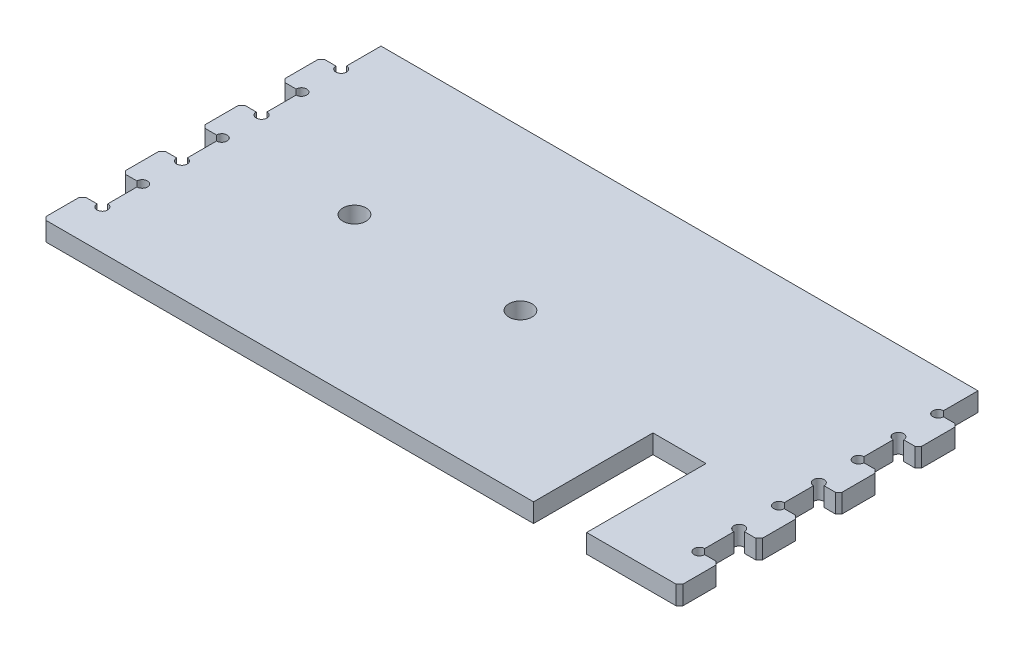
ISO-10303-21;
HEADER;
FILE_DESCRIPTION(('STEP AP214'),'2;1');
FILE_NAME('part.step','',(''),(''),'','','');
FILE_SCHEMA(('AUTOMOTIVE_DESIGN { 1 0 10303 214 1 1 1 1 }'));
ENDSEC;
DATA;
#1=APPLICATION_CONTEXT('core data for automotive mechanical design processes');
#2=APPLICATION_PROTOCOL_DEFINITION('international standard','automotive_design',2000,#1);
#3=PRODUCT_CONTEXT('',#1,'mechanical');
#4=PRODUCT('Part','Part','',(#3));
#5=PRODUCT_RELATED_PRODUCT_CATEGORY('part','',(#4));
#6=PRODUCT_DEFINITION_FORMATION('','',#4);
#7=PRODUCT_DEFINITION_CONTEXT('part definition',#1,'design');
#8=PRODUCT_DEFINITION('design','',#6,#7);
#9=PRODUCT_DEFINITION_SHAPE('','',#8);
#10=(LENGTH_UNIT() NAMED_UNIT(*) SI_UNIT(.MILLI.,.METRE.));
#11=(NAMED_UNIT(*) PLANE_ANGLE_UNIT() SI_UNIT($,.RADIAN.));
#12=(NAMED_UNIT(*) SI_UNIT($,.STERADIAN.) SOLID_ANGLE_UNIT());
#13=UNCERTAINTY_MEASURE_WITH_UNIT(LENGTH_MEASURE(1.E-05),#10,'distance_accuracy_value','');
#14=(GEOMETRIC_REPRESENTATION_CONTEXT(3) GLOBAL_UNCERTAINTY_ASSIGNED_CONTEXT((#13)) GLOBAL_UNIT_ASSIGNED_CONTEXT((#10,
#11,#12)) REPRESENTATION_CONTEXT('',''));
#15=CARTESIAN_POINT('',(0.,0.,0.));
#16=DIRECTION('',(0.,0.,1.));
#17=DIRECTION('',(1.,0.,0.));
#18=AXIS2_PLACEMENT_3D('',#15,#16,#17);
#19=CARTESIAN_POINT('',(0.,18.034,0.));
#20=DIRECTION('',(0.,0.,-1.));
#21=DIRECTION('',(-1.,0.,0.));
#22=AXIS2_PLACEMENT_3D('',#19,#20,#21);
#23=PLANE('',#22);
#24=DIRECTION('',(1.,0.,0.));
#25=VECTOR('',#24,1.);
#26=CARTESIAN_POINT('',(0.,0.,0.));
#27=LINE('',#26,#25);
#28=CARTESIAN_POINT('',(-15.8749999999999,0.,0.));
#29=VERTEX_POINT('',#28);
#30=CARTESIAN_POINT('',(450.85,0.,0.));
#31=VERTEX_POINT('',#30);
#32=EDGE_CURVE('E464',#29,#31,#27,.T.);
#33=ORIENTED_EDGE('',*,*,#32,.T.);
#34=DIRECTION('',(0.,1.,0.));
#35=VECTOR('',#34,1.);
#36=CARTESIAN_POINT('',(450.85,-0.001000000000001,0.));
#37=LINE('',#36,#35);
#38=CARTESIAN_POINT('',(450.85,18.034,0.));
#39=VERTEX_POINT('',#38);
#40=EDGE_CURVE('E445',#31,#39,#37,.T.);
#41=ORIENTED_EDGE('',*,*,#40,.T.);
#42=DIRECTION('',(1.,0.,0.));
#43=VECTOR('',#42,1.);
#44=CARTESIAN_POINT('',(0.,18.034,0.));
#45=LINE('',#44,#43);
#46=CARTESIAN_POINT('',(-15.8749999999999,18.034,0.));
#47=VERTEX_POINT('',#46);
#48=EDGE_CURVE('E723',#47,#39,#45,.T.);
#49=ORIENTED_EDGE('',*,*,#48,.F.);
#50=DIRECTION('',(0.,-1.,0.));
#51=VECTOR('',#50,1.);
#52=CARTESIAN_POINT('',(-15.8749999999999,0.,0.));
#53=LINE('',#52,#51);
#54=EDGE_CURVE('E469',#47,#29,#53,.T.);
#55=ORIENTED_EDGE('',*,*,#54,.T.);
#56=EDGE_LOOP('',(#33,#41,#49,#55));
#57=FACE_BOUND('',#56,.T.);
#58=ADVANCED_FACE('F33',(#57),#23,.F.);
#59=CARTESIAN_POINT('',(571.5,18.034,0.));
#60=DIRECTION('',(-1.,0.,0.));
#61=DIRECTION('',(0.,0.,1.));
#62=AXIS2_PLACEMENT_3D('',#59,#60,#61);
#63=PLANE('',#62);
#64=DIRECTION('',(0.,0.,-1.));
#65=VECTOR('',#64,1.);
#66=CARTESIAN_POINT('',(571.5,18.034,0.));
#67=LINE('',#66,#65);
#68=CARTESIAN_POINT('',(571.5,18.034,-271.78));
#69=VERTEX_POINT('',#68);
#70=CARTESIAN_POINT('',(571.5,18.034,-304.8));
#71=VERTEX_POINT('',#70);
#72=EDGE_CURVE('E725',#69,#71,#67,.T.);
#73=ORIENTED_EDGE('',*,*,#72,.F.);
#74=DIRECTION('',(0.,1.,0.));
#75=VECTOR('',#74,1.);
#76=CARTESIAN_POINT('',(571.5,-14.3684097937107,-271.78));
#77=LINE('',#76,#75);
#78=CARTESIAN_POINT('',(571.5,0.,-271.78));
#79=VERTEX_POINT('',#78);
#80=EDGE_CURVE('E759',#69,#79,#77,.F.);
#81=ORIENTED_EDGE('',*,*,#80,.T.);
#82=DIRECTION('',(0.,0.,-1.));
#83=VECTOR('',#82,1.);
#84=CARTESIAN_POINT('',(571.5,0.,0.));
#85=LINE('',#84,#83);
#86=CARTESIAN_POINT('',(571.5,0.,-304.8));
#87=VERTEX_POINT('',#86);
#88=EDGE_CURVE('E470',#79,#87,#85,.T.);
#89=ORIENTED_EDGE('',*,*,#88,.T.);
#90=DIRECTION('',(0.,-1.,0.));
#91=VECTOR('',#90,1.);
#92=CARTESIAN_POINT('',(571.5,18.034,-304.8));
#93=LINE('',#92,#91);
#94=EDGE_CURVE('E488',#71,#87,#93,.T.);
#95=ORIENTED_EDGE('',*,*,#94,.F.);
#96=EDGE_LOOP('',(#73,#81,#89,#95));
#97=FACE_BOUND('',#96,.T.);
#98=ADVANCED_FACE('F933',(#97),#63,.F.);
#99=CARTESIAN_POINT('',(0.,18.034,0.));
#100=DIRECTION('',(1.,0.,0.));
#101=DIRECTION('',(0.,0.,-1.));
#102=AXIS2_PLACEMENT_3D('',#99,#100,#101);
#103=PLANE('',#102);
#104=DIRECTION('',(0.,0.,1.));
#105=VECTOR('',#104,1.);
#106=CARTESIAN_POINT('',(0.,0.,0.));
#107=LINE('',#106,#105);
#108=CARTESIAN_POINT('',(0.,0.,-304.8));
#109=VERTEX_POINT('',#108);
#110=CARTESIAN_POINT('',(0.,0.,-271.78));
#111=VERTEX_POINT('',#110);
#112=EDGE_CURVE('E476',#109,#111,#107,.T.);
#113=ORIENTED_EDGE('',*,*,#112,.T.);
#114=DIRECTION('',(0.,1.,0.));
#115=VECTOR('',#114,1.);
#116=CARTESIAN_POINT('',(0.,-14.3684097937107,-271.78));
#117=LINE('',#116,#115);
#118=CARTESIAN_POINT('',(0.,18.034,-271.78));
#119=VERTEX_POINT('',#118);
#120=EDGE_CURVE('E806',#111,#119,#117,.T.);
#121=ORIENTED_EDGE('',*,*,#120,.T.);
#122=DIRECTION('',(0.,0.,1.));
#123=VECTOR('',#122,1.);
#124=CARTESIAN_POINT('',(0.,18.034,0.));
#125=LINE('',#124,#123);
#126=CARTESIAN_POINT('',(0.,18.034,-304.8));
#127=VERTEX_POINT('',#126);
#128=EDGE_CURVE('E717',#127,#119,#125,.T.);
#129=ORIENTED_EDGE('',*,*,#128,.F.);
#130=DIRECTION('',(0.,-1.,0.));
#131=VECTOR('',#130,1.);
#132=CARTESIAN_POINT('',(0.,18.034,-304.8));
#133=LINE('',#132,#131);
#134=EDGE_CURVE('E485',#127,#109,#133,.T.);
#135=ORIENTED_EDGE('',*,*,#134,.T.);
#136=EDGE_LOOP('',(#113,#121,#129,#135));
#137=FACE_BOUND('',#136,.T.);
#138=ADVANCED_FACE('F939',(#137),#103,.F.);
#139=CARTESIAN_POINT('',(571.5,18.034,-195.58));
#140=VERTEX_POINT('',#139);
#141=CARTESIAN_POINT('',(571.5,18.034,-223.52));
#142=VERTEX_POINT('',#141);
#143=EDGE_CURVE('E726',#140,#142,#67,.T.);
#144=ORIENTED_EDGE('',*,*,#143,.F.);
#145=DIRECTION('',(0.,1.,0.));
#146=VECTOR('',#145,1.);
#147=CARTESIAN_POINT('',(571.5,-14.3684097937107,-195.58));
#148=LINE('',#147,#146);
#149=CARTESIAN_POINT('',(571.5,0.,-195.58));
#150=VERTEX_POINT('',#149);
#151=EDGE_CURVE('E754',#140,#150,#148,.F.);
#152=ORIENTED_EDGE('',*,*,#151,.T.);
#153=CARTESIAN_POINT('',(571.5,0.,-223.52));
#154=VERTEX_POINT('',#153);
#155=EDGE_CURVE('E473',#150,#154,#85,.T.);
#156=ORIENTED_EDGE('',*,*,#155,.T.);
#157=DIRECTION('',(0.,1.,0.));
#158=VECTOR('',#157,1.);
#159=CARTESIAN_POINT('',(571.5,-14.3684097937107,-223.52));
#160=LINE('',#159,#158);
#161=EDGE_CURVE('E756',#154,#142,#160,.T.);
#162=ORIENTED_EDGE('',*,*,#161,.T.);
#163=EDGE_LOOP('',(#144,#152,#156,#162));
#164=FACE_BOUND('',#163,.T.);
#165=ADVANCED_FACE('F752',(#164),#63,.F.);
#166=CARTESIAN_POINT('',(0.,18.034,-223.52));
#167=VERTEX_POINT('',#166);
#168=CARTESIAN_POINT('',(0.,18.034,-195.58));
#169=VERTEX_POINT('',#168);
#170=EDGE_CURVE('E721',#167,#169,#125,.T.);
#171=ORIENTED_EDGE('',*,*,#170,.F.);
#172=DIRECTION('',(0.,1.,0.));
#173=VECTOR('',#172,1.);
#174=CARTESIAN_POINT('',(0.,-14.3684097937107,-223.52));
#175=LINE('',#174,#173);
#176=CARTESIAN_POINT('',(0.,0.,-223.52));
#177=VERTEX_POINT('',#176);
#178=EDGE_CURVE('E763',#167,#177,#175,.F.);
#179=ORIENTED_EDGE('',*,*,#178,.T.);
#180=CARTESIAN_POINT('',(0.,0.,-195.58));
#181=VERTEX_POINT('',#180);
#182=EDGE_CURVE('E1161',#177,#181,#107,.T.);
#183=ORIENTED_EDGE('',*,*,#182,.T.);
#184=DIRECTION('',(0.,1.,0.));
#185=VECTOR('',#184,1.);
#186=CARTESIAN_POINT('',(0.,-14.3684097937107,-195.58));
#187=LINE('',#186,#185);
#188=EDGE_CURVE('E781',#181,#169,#187,.T.);
#189=ORIENTED_EDGE('',*,*,#188,.T.);
#190=EDGE_LOOP('',(#171,#179,#183,#189));
#191=FACE_BOUND('',#190,.T.);
#192=ADVANCED_FACE('F1143',(#191),#103,.F.);
#193=CARTESIAN_POINT('',(571.5,18.034,-119.38));
#194=VERTEX_POINT('',#193);
#195=CARTESIAN_POINT('',(571.5,18.034,-147.32));
#196=VERTEX_POINT('',#195);
#197=EDGE_CURVE('E732',#194,#196,#67,.T.);
#198=ORIENTED_EDGE('',*,*,#197,.F.);
#199=DIRECTION('',(0.,1.,0.));
#200=VECTOR('',#199,1.);
#201=CARTESIAN_POINT('',(571.5,-14.3684097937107,-119.38));
#202=LINE('',#201,#200);
#203=CARTESIAN_POINT('',(571.5,0.,-119.38));
#204=VERTEX_POINT('',#203);
#205=EDGE_CURVE('E787',#194,#204,#202,.F.);
#206=ORIENTED_EDGE('',*,*,#205,.T.);
#207=CARTESIAN_POINT('',(571.5,0.,-147.32));
#208=VERTEX_POINT('',#207);
#209=EDGE_CURVE('E482',#204,#208,#85,.T.);
#210=ORIENTED_EDGE('',*,*,#209,.T.);
#211=DIRECTION('',(0.,1.,0.));
#212=VECTOR('',#211,1.);
#213=CARTESIAN_POINT('',(571.5,-14.3684097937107,-147.32));
#214=LINE('',#213,#212);
#215=EDGE_CURVE('E774',#208,#196,#214,.T.);
#216=ORIENTED_EDGE('',*,*,#215,.T.);
#217=EDGE_LOOP('',(#198,#206,#210,#216));
#218=FACE_BOUND('',#217,.T.);
#219=ADVANCED_FACE('F1138',(#218),#63,.F.);
#220=CARTESIAN_POINT('',(0.,18.034,-147.32));
#221=VERTEX_POINT('',#220);
#222=CARTESIAN_POINT('',(0.,18.034,-119.38));
#223=VERTEX_POINT('',#222);
#224=EDGE_CURVE('E722',#221,#223,#125,.T.);
#225=ORIENTED_EDGE('',*,*,#224,.F.);
#226=DIRECTION('',(0.,1.,0.));
#227=VECTOR('',#226,1.);
#228=CARTESIAN_POINT('',(0.,-14.3684097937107,-147.32));
#229=LINE('',#228,#227);
#230=CARTESIAN_POINT('',(0.,0.,-147.32));
#231=VERTEX_POINT('',#230);
#232=EDGE_CURVE('E778',#221,#231,#229,.F.);
#233=ORIENTED_EDGE('',*,*,#232,.T.);
#234=CARTESIAN_POINT('',(0.,0.,-119.38));
#235=VERTEX_POINT('',#234);
#236=EDGE_CURVE('E1163',#231,#235,#107,.T.);
#237=ORIENTED_EDGE('',*,*,#236,.T.);
#238=DIRECTION('',(0.,1.,0.));
#239=VECTOR('',#238,1.);
#240=CARTESIAN_POINT('',(0.,-14.3684097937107,-119.38));
#241=LINE('',#240,#239);
#242=EDGE_CURVE('E793',#235,#223,#241,.T.);
#243=ORIENTED_EDGE('',*,*,#242,.T.);
#244=EDGE_LOOP('',(#225,#233,#237,#243));
#245=FACE_BOUND('',#244,.T.);
#246=ADVANCED_FACE('F956',(#245),#103,.F.);
#247=CARTESIAN_POINT('',(571.5,18.034,-43.18));
#248=VERTEX_POINT('',#247);
#249=CARTESIAN_POINT('',(571.5,18.034,-71.12));
#250=VERTEX_POINT('',#249);
#251=EDGE_CURVE('E727',#248,#250,#67,.T.);
#252=ORIENTED_EDGE('',*,*,#251,.F.);
#253=DIRECTION('',(0.,1.,0.));
#254=VECTOR('',#253,1.);
#255=CARTESIAN_POINT('',(571.5,-14.3684097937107,-43.18));
#256=LINE('',#255,#254);
#257=CARTESIAN_POINT('',(571.5,0.,-43.18));
#258=VERTEX_POINT('',#257);
#259=EDGE_CURVE('E796',#248,#258,#256,.F.);
#260=ORIENTED_EDGE('',*,*,#259,.T.);
#261=CARTESIAN_POINT('',(571.5,0.,-71.12));
#262=VERTEX_POINT('',#261);
#263=EDGE_CURVE('E475',#258,#262,#85,.T.);
#264=ORIENTED_EDGE('',*,*,#263,.T.);
#265=DIRECTION('',(0.,1.,0.));
#266=VECTOR('',#265,1.);
#267=CARTESIAN_POINT('',(571.5,-14.3684097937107,-71.12));
#268=LINE('',#267,#266);
#269=EDGE_CURVE('E784',#262,#250,#268,.T.);
#270=ORIENTED_EDGE('',*,*,#269,.T.);
#271=EDGE_LOOP('',(#252,#260,#264,#270));
#272=FACE_BOUND('',#271,.T.);
#273=ADVANCED_FACE('F942',(#272),#63,.F.);
#274=CARTESIAN_POINT('',(0.,18.034,0.));
#275=DIRECTION('',(0.,-1.,0.));
#276=DIRECTION('',(0.,0.,-1.));
#277=AXIS2_PLACEMENT_3D('',#274,#275,#276);
#278=PLANE('',#277);
#279=ORIENTED_EDGE('',*,*,#48,.T.);
#280=DIRECTION('',(0.,0.,1.));
#281=VECTOR('',#280,1.);
#282=CARTESIAN_POINT('',(450.85,18.034,0.));
#283=LINE('',#282,#281);
#284=CARTESIAN_POINT('',(450.85,18.034,-114.3));
#285=VERTEX_POINT('',#284);
#286=EDGE_CURVE('E451',#285,#39,#283,.T.);
#287=ORIENTED_EDGE('',*,*,#286,.F.);
#288=DIRECTION('',(-1.,0.,0.));
#289=VECTOR('',#288,1.);
#290=CARTESIAN_POINT('',(450.85,18.034,-114.3));
#291=LINE('',#290,#289);
#292=CARTESIAN_POINT('',(501.65,18.034,-114.3));
#293=VERTEX_POINT('',#292);
#294=EDGE_CURVE('E457',#293,#285,#291,.T.);
#295=ORIENTED_EDGE('',*,*,#294,.F.);
#296=DIRECTION('',(0.,0.,-1.));
#297=VECTOR('',#296,1.);
#298=CARTESIAN_POINT('',(501.65,18.034,0.));
#299=LINE('',#298,#297);
#300=CARTESIAN_POINT('',(501.65,18.034,0.));
#301=VERTEX_POINT('',#300);
#302=EDGE_CURVE('E961',#301,#293,#299,.T.);
#303=ORIENTED_EDGE('',*,*,#302,.F.);
#304=CARTESIAN_POINT('',(587.375,18.034,0.));
#305=VERTEX_POINT('',#304);
#306=EDGE_CURVE('E720',#301,#305,#45,.T.);
#307=ORIENTED_EDGE('',*,*,#306,.T.);
#308=DIRECTION('',(0.707106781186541,0.,-0.707106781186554));
#309=VECTOR('',#308,1.);
#310=CARTESIAN_POINT('',(587.375,18.034,0.));
#311=LINE('',#310,#309);
#312=CARTESIAN_POINT('',(590.55,18.034,-3.17500000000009));
#313=VERTEX_POINT('',#312);
#314=EDGE_CURVE('E526',#305,#313,#311,.T.);
#315=ORIENTED_EDGE('',*,*,#314,.T.);
#316=DIRECTION('',(0.,0.,-1.));
#317=VECTOR('',#316,1.);
#318=CARTESIAN_POINT('',(590.55,18.034,0.));
#319=LINE('',#318,#317);
#320=CARTESIAN_POINT('',(590.55,18.034,-34.925));
#321=VERTEX_POINT('',#320);
#322=EDGE_CURVE('E902',#313,#321,#319,.T.);
#323=ORIENTED_EDGE('',*,*,#322,.T.);
#324=DIRECTION('',(0.707106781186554,0.,0.707106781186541));
#325=VECTOR('',#324,1.);
#326=CARTESIAN_POINT('',(590.55,18.034,-34.925));
#327=LINE('',#326,#325);
#328=CARTESIAN_POINT('',(587.375,18.034,-38.1000000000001));
#329=VERTEX_POINT('',#328);
#330=EDGE_CURVE('E524',#321,#329,#327,.F.);
#331=ORIENTED_EDGE('',*,*,#330,.T.);
#332=DIRECTION('',(-1.,0.,0.));
#333=VECTOR('',#332,1.);
#334=CARTESIAN_POINT('',(571.5,18.034,-38.1000000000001));
#335=LINE('',#334,#333);
#336=CARTESIAN_POINT('',(576.580000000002,18.034,-38.1000000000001));
#337=VERTEX_POINT('',#336);
#338=EDGE_CURVE('E693',#329,#337,#335,.T.);
#339=ORIENTED_EDGE('',*,*,#338,.T.);
#340=CARTESIAN_POINT('',(571.500000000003,18.034,-38.1));
#341=DIRECTION('',(0.,1.,0.));
#342=DIRECTION('',(0.,0.,1.));
#343=AXIS2_PLACEMENT_3D('',#340,#341,#342);
#344=CIRCLE('',#343,5.08000000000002);
#345=EDGE_CURVE('E673',#248,#337,#344,.T.);
#346=ORIENTED_EDGE('',*,*,#345,.F.);
#347=ORIENTED_EDGE('',*,*,#251,.T.);
#348=CARTESIAN_POINT('',(571.500000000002,18.034,-76.2));
#349=DIRECTION('',(0.,1.,0.));
#350=DIRECTION('',(0.,0.,1.));
#351=AXIS2_PLACEMENT_3D('',#348,#349,#350);
#352=CIRCLE('',#351,5.08000000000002);
#353=CARTESIAN_POINT('',(576.580000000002,18.034,-76.2));
#354=VERTEX_POINT('',#353);
#355=EDGE_CURVE('E683',#354,#250,#352,.T.);
#356=ORIENTED_EDGE('',*,*,#355,.F.);
#357=DIRECTION('',(1.,0.,0.));
#358=VECTOR('',#357,1.);
#359=CARTESIAN_POINT('',(571.5,18.034,-76.2));
#360=LINE('',#359,#358);
#361=CARTESIAN_POINT('',(587.375,18.034,-76.2));
#362=VERTEX_POINT('',#361);
#363=EDGE_CURVE('E870',#354,#362,#360,.T.);
#364=ORIENTED_EDGE('',*,*,#363,.T.);
#365=DIRECTION('',(-0.707106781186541,0.,0.707106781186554));
#366=VECTOR('',#365,1.);
#367=CARTESIAN_POINT('',(587.375,18.034,-76.2));
#368=LINE('',#367,#366);
#369=CARTESIAN_POINT('',(590.55,18.034,-79.375));
#370=VERTEX_POINT('',#369);
#371=EDGE_CURVE('E522',#362,#370,#368,.F.);
#372=ORIENTED_EDGE('',*,*,#371,.T.);
#373=DIRECTION('',(0.,0.,-1.));
#374=VECTOR('',#373,1.);
#375=CARTESIAN_POINT('',(590.55,18.034,-76.2000000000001));
#376=LINE('',#375,#374);
#377=CARTESIAN_POINT('',(590.55,18.034,-111.125));
#378=VERTEX_POINT('',#377);
#379=EDGE_CURVE('E877',#370,#378,#376,.T.);
#380=ORIENTED_EDGE('',*,*,#379,.T.);
#381=DIRECTION('',(0.707106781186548,0.,0.707106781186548));
#382=VECTOR('',#381,1.);
#383=CARTESIAN_POINT('',(590.55,18.034,-111.125));
#384=LINE('',#383,#382);
#385=CARTESIAN_POINT('',(587.375,18.034,-114.3));
#386=VERTEX_POINT('',#385);
#387=EDGE_CURVE('E520',#378,#386,#384,.F.);
#388=ORIENTED_EDGE('',*,*,#387,.T.);
#389=DIRECTION('',(-1.,0.,0.));
#390=VECTOR('',#389,1.);
#391=CARTESIAN_POINT('',(571.5,18.034,-114.3));
#392=LINE('',#391,#390);
#393=CARTESIAN_POINT('',(576.580000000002,18.034,-114.3));
#394=VERTEX_POINT('',#393);
#395=EDGE_CURVE('E873',#386,#394,#392,.T.);
#396=ORIENTED_EDGE('',*,*,#395,.T.);
#397=CARTESIAN_POINT('',(571.500000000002,18.034,-114.3));
#398=DIRECTION('',(0.,1.,0.));
#399=DIRECTION('',(0.,0.,1.));
#400=AXIS2_PLACEMENT_3D('',#397,#398,#399);
#401=CIRCLE('',#400,5.08000000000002);
#402=EDGE_CURVE('E1015',#194,#394,#401,.T.);
#403=ORIENTED_EDGE('',*,*,#402,.F.);
#404=ORIENTED_EDGE('',*,*,#197,.T.);
#405=CARTESIAN_POINT('',(571.500000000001,18.034,-152.4));
#406=DIRECTION('',(0.,1.,0.));
#407=DIRECTION('',(0.,0.,1.));
#408=AXIS2_PLACEMENT_3D('',#405,#406,#407);
#409=CIRCLE('',#408,5.08000000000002);
#410=CARTESIAN_POINT('',(576.580000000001,18.034,-152.4));
#411=VERTEX_POINT('',#410);
#412=EDGE_CURVE('E1010',#411,#196,#409,.T.);
#413=ORIENTED_EDGE('',*,*,#412,.F.);
#414=DIRECTION('',(1.,0.,0.));
#415=VECTOR('',#414,1.);
#416=CARTESIAN_POINT('',(571.499999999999,18.034,-152.4));
#417=LINE('',#416,#415);
#418=CARTESIAN_POINT('',(587.374999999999,18.034,-152.4));
#419=VERTEX_POINT('',#418);
#420=EDGE_CURVE('E839',#411,#419,#417,.T.);
#421=ORIENTED_EDGE('',*,*,#420,.T.);
#422=DIRECTION('',(-0.707106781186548,0.,0.707106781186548));
#423=VECTOR('',#422,1.);
#424=CARTESIAN_POINT('',(587.374999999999,18.034,-152.4));
#425=LINE('',#424,#423);
#426=CARTESIAN_POINT('',(590.549999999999,18.034,-155.575));
#427=VERTEX_POINT('',#426);
#428=EDGE_CURVE('E518',#419,#427,#425,.F.);
#429=ORIENTED_EDGE('',*,*,#428,.T.);
#430=DIRECTION('',(0.,0.,-1.));
#431=VECTOR('',#430,1.);
#432=CARTESIAN_POINT('',(590.549999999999,18.034,-152.4));
#433=LINE('',#432,#431);
#434=CARTESIAN_POINT('',(590.549999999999,18.034,-187.325));
#435=VERTEX_POINT('',#434);
#436=EDGE_CURVE('E845',#427,#435,#433,.T.);
#437=ORIENTED_EDGE('',*,*,#436,.T.);
#438=DIRECTION('',(0.707106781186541,0.,0.707106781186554));
#439=VECTOR('',#438,1.);
#440=CARTESIAN_POINT('',(590.549999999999,18.034,-187.325));
#441=LINE('',#440,#439);
#442=CARTESIAN_POINT('',(587.374999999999,18.034,-190.5));
#443=VERTEX_POINT('',#442);
#444=EDGE_CURVE('E516',#435,#443,#441,.F.);
#445=ORIENTED_EDGE('',*,*,#444,.T.);
#446=DIRECTION('',(-1.,0.,0.));
#447=VECTOR('',#446,1.);
#448=CARTESIAN_POINT('',(571.499999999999,18.034,-190.5));
#449=LINE('',#448,#447);
#450=CARTESIAN_POINT('',(576.580000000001,18.034,-190.5));
#451=VERTEX_POINT('',#450);
#452=EDGE_CURVE('E842',#443,#451,#449,.T.);
#453=ORIENTED_EDGE('',*,*,#452,.T.);
#454=CARTESIAN_POINT('',(571.500000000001,18.034,-190.5));
#455=DIRECTION('',(0.,1.,0.));
#456=DIRECTION('',(0.,0.,1.));
#457=AXIS2_PLACEMENT_3D('',#454,#455,#456);
#458=CIRCLE('',#457,5.08000000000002);
#459=EDGE_CURVE('E748',#140,#451,#458,.T.);
#460=ORIENTED_EDGE('',*,*,#459,.F.);
#461=ORIENTED_EDGE('',*,*,#143,.T.);
#462=CARTESIAN_POINT('',(571.5,18.034,-228.6));
#463=DIRECTION('',(0.,1.,0.));
#464=DIRECTION('',(0.,0.,1.));
#465=AXIS2_PLACEMENT_3D('',#462,#463,#464);
#466=CIRCLE('',#465,5.08000000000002);
#467=CARTESIAN_POINT('',(576.58,18.034,-228.6));
#468=VERTEX_POINT('',#467);
#469=EDGE_CURVE('E745',#468,#142,#466,.T.);
#470=ORIENTED_EDGE('',*,*,#469,.F.);
#471=DIRECTION('',(1.,0.,0.));
#472=VECTOR('',#471,1.);
#473=CARTESIAN_POINT('',(571.499999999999,18.034,-228.6));
#474=LINE('',#473,#472);
#475=CARTESIAN_POINT('',(587.374999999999,18.034,-228.6));
#476=VERTEX_POINT('',#475);
#477=EDGE_CURVE('E809',#468,#476,#474,.T.);
#478=ORIENTED_EDGE('',*,*,#477,.T.);
#479=DIRECTION('',(-0.707106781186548,0.,0.707106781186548));
#480=VECTOR('',#479,1.);
#481=CARTESIAN_POINT('',(587.374999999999,18.034,-228.6));
#482=LINE('',#481,#480);
#483=CARTESIAN_POINT('',(590.549999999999,18.034,-231.775));
#484=VERTEX_POINT('',#483);
#485=EDGE_CURVE('E514',#476,#484,#482,.F.);
#486=ORIENTED_EDGE('',*,*,#485,.T.);
#487=DIRECTION('',(0.,0.,-1.));
#488=VECTOR('',#487,1.);
#489=CARTESIAN_POINT('',(590.549999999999,18.034,-228.6));
#490=LINE('',#489,#488);
#491=CARTESIAN_POINT('',(590.549999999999,18.034,-263.525));
#492=VERTEX_POINT('',#491);
#493=EDGE_CURVE('E814',#484,#492,#490,.T.);
#494=ORIENTED_EDGE('',*,*,#493,.T.);
#495=DIRECTION('',(0.707106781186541,0.,0.707106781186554));
#496=VECTOR('',#495,1.);
#497=CARTESIAN_POINT('',(590.549999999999,18.034,-263.525));
#498=LINE('',#497,#496);
#499=CARTESIAN_POINT('',(587.374999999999,18.034,-266.7));
#500=VERTEX_POINT('',#499);
#501=EDGE_CURVE('E512',#492,#500,#498,.F.);
#502=ORIENTED_EDGE('',*,*,#501,.T.);
#503=DIRECTION('',(-1.,0.,0.));
#504=VECTOR('',#503,1.);
#505=CARTESIAN_POINT('',(571.499999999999,18.034,-266.7));
#506=LINE('',#505,#504);
#507=CARTESIAN_POINT('',(576.58,18.034,-266.7));
#508=VERTEX_POINT('',#507);
#509=EDGE_CURVE('E810',#500,#508,#506,.T.);
#510=ORIENTED_EDGE('',*,*,#509,.T.);
#511=CARTESIAN_POINT('',(571.5,18.034,-266.7));
#512=DIRECTION('',(0.,1.,0.));
#513=DIRECTION('',(0.,0.,1.));
#514=AXIS2_PLACEMENT_3D('',#511,#512,#513);
#515=CIRCLE('',#514,5.08000000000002);
#516=EDGE_CURVE('E766',#69,#508,#515,.T.);
#517=ORIENTED_EDGE('',*,*,#516,.F.);
#518=ORIENTED_EDGE('',*,*,#72,.T.);
#519=DIRECTION('',(-1.,0.,0.));
#520=VECTOR('',#519,1.);
#521=CARTESIAN_POINT('',(0.,18.034,-304.8));
#522=LINE('',#521,#520);
#523=EDGE_CURVE('E489',#71,#127,#522,.T.);
#524=ORIENTED_EDGE('',*,*,#523,.T.);
#525=ORIENTED_EDGE('',*,*,#128,.T.);
#526=CARTESIAN_POINT('',(0.,18.034,-266.7));
#527=DIRECTION('',(0.,1.,0.));
#528=DIRECTION('',(0.,0.,1.));
#529=AXIS2_PLACEMENT_3D('',#526,#527,#528);
#530=CIRCLE('',#529,5.08000000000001);
#531=CARTESIAN_POINT('',(-5.08000000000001,18.034,-266.7));
#532=VERTEX_POINT('',#531);
#533=EDGE_CURVE('E801',#532,#119,#530,.T.);
#534=ORIENTED_EDGE('',*,*,#533,.F.);
#535=DIRECTION('',(-1.,0.,0.));
#536=VECTOR('',#535,1.);
#537=CARTESIAN_POINT('',(-7.9815263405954E-13,18.034,-266.7));
#538=LINE('',#537,#536);
#539=CARTESIAN_POINT('',(-15.8750000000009,18.034,-266.7));
#540=VERTEX_POINT('',#539);
#541=EDGE_CURVE('E823',#532,#540,#538,.T.);
#542=ORIENTED_EDGE('',*,*,#541,.T.);
#543=DIRECTION('',(0.707106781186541,0.,-0.707106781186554));
#544=VECTOR('',#543,1.);
#545=CARTESIAN_POINT('',(-15.8750000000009,18.034,-266.7));
#546=LINE('',#545,#544);
#547=CARTESIAN_POINT('',(-19.0500000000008,18.034,-263.525));
#548=VERTEX_POINT('',#547);
#549=EDGE_CURVE('E496',#540,#548,#546,.F.);
#550=ORIENTED_EDGE('',*,*,#549,.T.);
#551=DIRECTION('',(0.,0.,1.));
#552=VECTOR('',#551,1.);
#553=CARTESIAN_POINT('',(-19.0500000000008,18.034,-228.6));
#554=LINE('',#553,#552);
#555=CARTESIAN_POINT('',(-19.0500000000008,18.034,-231.775));
#556=VERTEX_POINT('',#555);
#557=EDGE_CURVE('E830',#548,#556,#554,.T.);
#558=ORIENTED_EDGE('',*,*,#557,.T.);
#559=DIRECTION('',(-0.707106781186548,0.,-0.707106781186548));
#560=VECTOR('',#559,1.);
#561=CARTESIAN_POINT('',(-19.0500000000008,18.034,-231.775));
#562=LINE('',#561,#560);
#563=CARTESIAN_POINT('',(-15.8750000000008,18.034,-228.6));
#564=VERTEX_POINT('',#563);
#565=EDGE_CURVE('E498',#556,#564,#562,.F.);
#566=ORIENTED_EDGE('',*,*,#565,.T.);
#567=DIRECTION('',(1.,0.,0.));
#568=VECTOR('',#567,1.);
#569=CARTESIAN_POINT('',(-7.9815263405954E-13,18.034,-228.6));
#570=LINE('',#569,#568);
#571=CARTESIAN_POINT('',(-5.07999999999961,18.034,-228.6));
#572=VERTEX_POINT('',#571);
#573=EDGE_CURVE('E826',#564,#572,#570,.T.);
#574=ORIENTED_EDGE('',*,*,#573,.T.);
#575=CARTESIAN_POINT('',(3.9907631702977E-13,18.034,-228.6));
#576=DIRECTION('',(0.,1.,0.));
#577=DIRECTION('',(0.,0.,1.));
#578=AXIS2_PLACEMENT_3D('',#575,#576,#577);
#579=CIRCLE('',#578,5.08000000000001);
#580=EDGE_CURVE('E993',#167,#572,#579,.T.);
#581=ORIENTED_EDGE('',*,*,#580,.F.);
#582=ORIENTED_EDGE('',*,*,#170,.T.);
#583=CARTESIAN_POINT('',(7.9815263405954E-13,18.034,-190.5));
#584=DIRECTION('',(0.,1.,0.));
#585=DIRECTION('',(0.,0.,1.));
#586=AXIS2_PLACEMENT_3D('',#583,#584,#585);
#587=CIRCLE('',#586,5.08000000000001);
#588=CARTESIAN_POINT('',(-5.07999999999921,18.034,-190.5));
#589=VERTEX_POINT('',#588);
#590=EDGE_CURVE('E979',#589,#169,#587,.T.);
#591=ORIENTED_EDGE('',*,*,#590,.F.);
#592=DIRECTION('',(-1.,0.,0.));
#593=VECTOR('',#592,1.);
#594=CARTESIAN_POINT('',(-5.32101756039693E-13,18.034,-190.5));
#595=LINE('',#594,#593);
#596=CARTESIAN_POINT('',(-15.8750000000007,18.034,-190.5));
#597=VERTEX_POINT('',#596);
#598=EDGE_CURVE('E854',#589,#597,#595,.T.);
#599=ORIENTED_EDGE('',*,*,#598,.T.);
#600=DIRECTION('',(0.707106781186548,0.,-0.707106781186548));
#601=VECTOR('',#600,1.);
#602=CARTESIAN_POINT('',(-15.8750000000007,18.034,-190.5));
#603=LINE('',#602,#601);
#604=CARTESIAN_POINT('',(-19.0500000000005,18.034,-187.325));
#605=VERTEX_POINT('',#604);
#606=EDGE_CURVE('E500',#597,#605,#603,.F.);
#607=ORIENTED_EDGE('',*,*,#606,.T.);
#608=DIRECTION('',(0.,0.,1.));
#609=VECTOR('',#608,1.);
#610=CARTESIAN_POINT('',(-19.0500000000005,18.034,-152.4));
#611=LINE('',#610,#609);
#612=CARTESIAN_POINT('',(-19.0500000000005,18.034,-155.575));
#613=VERTEX_POINT('',#612);
#614=EDGE_CURVE('E861',#605,#613,#611,.T.);
#615=ORIENTED_EDGE('',*,*,#614,.T.);
#616=DIRECTION('',(-0.707106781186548,0.,-0.707106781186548));
#617=VECTOR('',#616,1.);
#618=CARTESIAN_POINT('',(-19.0500000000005,18.034,-155.575));
#619=LINE('',#618,#617);
#620=CARTESIAN_POINT('',(-15.8750000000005,18.034,-152.4));
#621=VERTEX_POINT('',#620);
#622=EDGE_CURVE('E502',#613,#621,#619,.F.);
#623=ORIENTED_EDGE('',*,*,#622,.T.);
#624=DIRECTION('',(1.,0.,0.));
#625=VECTOR('',#624,1.);
#626=CARTESIAN_POINT('',(-5.32101756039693E-13,18.034,-152.4));
#627=LINE('',#626,#625);
#628=CARTESIAN_POINT('',(-5.07999999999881,18.034,-152.4));
#629=VERTEX_POINT('',#628);
#630=EDGE_CURVE('E857',#621,#629,#627,.T.);
#631=ORIENTED_EDGE('',*,*,#630,.T.);
#632=CARTESIAN_POINT('',(1.19722895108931E-12,18.034,-152.4));
#633=DIRECTION('',(0.,1.,0.));
#634=DIRECTION('',(0.,0.,1.));
#635=AXIS2_PLACEMENT_3D('',#632,#633,#634);
#636=CIRCLE('',#635,5.08000000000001);
#637=EDGE_CURVE('E973',#221,#629,#636,.T.);
#638=ORIENTED_EDGE('',*,*,#637,.F.);
#639=ORIENTED_EDGE('',*,*,#224,.T.);
#640=CARTESIAN_POINT('',(1.59630526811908E-12,18.034,-114.3));
#641=DIRECTION('',(0.,1.,0.));
#642=DIRECTION('',(0.,0.,1.));
#643=AXIS2_PLACEMENT_3D('',#640,#641,#642);
#644=CIRCLE('',#643,5.08000000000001);
#645=CARTESIAN_POINT('',(-5.07999999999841,18.034,-114.3));
#646=VERTEX_POINT('',#645);
#647=EDGE_CURVE('E980',#646,#223,#644,.T.);
#648=ORIENTED_EDGE('',*,*,#647,.F.);
#649=DIRECTION('',(-1.,0.,0.));
#650=VECTOR('',#649,1.);
#651=CARTESIAN_POINT('',(-2.66050878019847E-13,18.034,-114.3));
#652=LINE('',#651,#650);
#653=CARTESIAN_POINT('',(-15.8750000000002,18.034,-114.3));
#654=VERTEX_POINT('',#653);
#655=EDGE_CURVE('E886',#646,#654,#652,.T.);
#656=ORIENTED_EDGE('',*,*,#655,.T.);
#657=DIRECTION('',(0.707106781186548,0.,-0.707106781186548));
#658=VECTOR('',#657,1.);
#659=CARTESIAN_POINT('',(-15.8750000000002,18.034,-114.3));
#660=LINE('',#659,#658);
#661=CARTESIAN_POINT('',(-19.0500000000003,18.034,-111.125));
#662=VERTEX_POINT('',#661);
#663=EDGE_CURVE('E504',#654,#662,#660,.F.);
#664=ORIENTED_EDGE('',*,*,#663,.T.);
#665=DIRECTION('',(0.,0.,1.));
#666=VECTOR('',#665,1.);
#667=CARTESIAN_POINT('',(-19.0500000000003,18.034,-76.2));
#668=LINE('',#667,#666);
#669=CARTESIAN_POINT('',(-19.0500000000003,18.034,-79.3750000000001));
#670=VERTEX_POINT('',#669);
#671=EDGE_CURVE('E893',#662,#670,#668,.T.);
#672=ORIENTED_EDGE('',*,*,#671,.T.);
#673=DIRECTION('',(-0.707106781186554,0.,-0.707106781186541));
#674=VECTOR('',#673,1.);
#675=CARTESIAN_POINT('',(-19.0500000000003,18.034,-79.3750000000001));
#676=LINE('',#675,#674);
#677=CARTESIAN_POINT('',(-15.8750000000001,18.034,-76.2));
#678=VERTEX_POINT('',#677);
#679=EDGE_CURVE('E506',#670,#678,#676,.F.);
#680=ORIENTED_EDGE('',*,*,#679,.T.);
#681=DIRECTION('',(1.,0.,0.));
#682=VECTOR('',#681,1.);
#683=CARTESIAN_POINT('',(-2.66050878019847E-13,18.034,-76.2));
#684=LINE('',#683,#682);
#685=CARTESIAN_POINT('',(-5.07999999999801,18.034,-76.2));
#686=VERTEX_POINT('',#685);
#687=EDGE_CURVE('E889',#678,#686,#684,.T.);
#688=ORIENTED_EDGE('',*,*,#687,.T.);
#689=CARTESIAN_POINT('',(1.99538158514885E-12,18.034,-76.2));
#690=DIRECTION('',(0.,1.,0.));
#691=DIRECTION('',(0.,0.,1.));
#692=AXIS2_PLACEMENT_3D('',#689,#690,#691);
#693=CIRCLE('',#692,5.08000000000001);
#694=CARTESIAN_POINT('',(1.99538158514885E-12,18.034,-71.12));
#695=VERTEX_POINT('',#694);
#696=EDGE_CURVE('E985',#695,#686,#693,.T.);
#697=ORIENTED_EDGE('',*,*,#696,.F.);
#698=CARTESIAN_POINT('',(0.,18.034,-43.18));
#699=VERTEX_POINT('',#698);
#700=EDGE_CURVE('E484',#695,#699,#125,.T.);
#701=ORIENTED_EDGE('',*,*,#700,.T.);
#702=CARTESIAN_POINT('',(2.39445790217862E-12,18.034,-38.1));
#703=DIRECTION('',(0.,1.,0.));
#704=DIRECTION('',(0.,0.,1.));
#705=AXIS2_PLACEMENT_3D('',#702,#703,#704);
#706=CIRCLE('',#705,5.08000000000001);
#707=CARTESIAN_POINT('',(-5.07999999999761,18.034,-38.1));
#708=VERTEX_POINT('',#707);
#709=EDGE_CURVE('E969',#708,#699,#706,.T.);
#710=ORIENTED_EDGE('',*,*,#709,.F.);
#711=DIRECTION('',(-1.,0.,0.));
#712=VECTOR('',#711,1.);
#713=CARTESIAN_POINT('',(0.,18.034,-38.1));
#714=LINE('',#713,#712);
#715=CARTESIAN_POINT('',(-15.875,18.034,-38.1));
#716=VERTEX_POINT('',#715);
#717=EDGE_CURVE('E687',#708,#716,#714,.T.);
#718=ORIENTED_EDGE('',*,*,#717,.T.);
#719=DIRECTION('',(0.707106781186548,0.,-0.707106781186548));
#720=VECTOR('',#719,1.);
#721=CARTESIAN_POINT('',(-15.875,18.034,-38.1));
#722=LINE('',#721,#720);
#723=CARTESIAN_POINT('',(-19.05,18.034,-34.9249999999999));
#724=VERTEX_POINT('',#723);
#725=EDGE_CURVE('E508',#716,#724,#722,.F.);
#726=ORIENTED_EDGE('',*,*,#725,.T.);
#727=DIRECTION('',(0.,0.,1.));
#728=VECTOR('',#727,1.);
#729=CARTESIAN_POINT('',(-19.05,18.034,0.));
#730=LINE('',#729,#728);
#731=CARTESIAN_POINT('',(-19.05,18.034,-3.17500000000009));
#732=VERTEX_POINT('',#731);
#733=EDGE_CURVE('E690',#724,#732,#730,.T.);
#734=ORIENTED_EDGE('',*,*,#733,.T.);
#735=DIRECTION('',(0.707106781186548,0.,0.707106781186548));
#736=VECTOR('',#735,1.);
#737=CARTESIAN_POINT('',(-19.05,18.034,-3.17500000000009));
#738=LINE('',#737,#736);
#739=EDGE_CURVE('E510',#732,#47,#738,.T.);
#740=ORIENTED_EDGE('',*,*,#739,.T.);
#741=EDGE_LOOP('',(#279,#287,#295,#303,#307,#315,#323,#331,#339,#346,#347,#356,#364,#372,#380,
#388,#396,#403,#404,#413,#421,#429,#437,#445,#453,#460,#461,#470,#478,#486,#494,#502,#510,#517,
#518,#524,#525,#534,#542,#550,#558,#566,#574,#581,#582,#591,#599,#607,#615,#623,#631,#638,#639,
#648,#656,#664,#672,#680,#688,#697,#701,#710,#718,#726,#734,#740));
#742=FACE_BOUND('',#741,.T.);
#743=CARTESIAN_POINT('',(127.,18.034,-152.4));
#744=DIRECTION('',(0.,1.,0.));
#745=DIRECTION('',(0.,0.,1.));
#746=AXIS2_PLACEMENT_3D('',#743,#744,#745);
#747=CIRCLE('',#746,11.1125);
#748=CARTESIAN_POINT('',(127.,18.034,-141.2875));
#749=VERTEX_POINT('',#748);
#750=EDGE_CURVE('E711',#749,#749,#747,.T.);
#751=ORIENTED_EDGE('',*,*,#750,.F.);
#752=EDGE_LOOP('',(#751));
#753=FACE_BOUND('',#752,.T.);
#754=CARTESIAN_POINT('',(285.877,18.034,-152.4));
#755=DIRECTION('',(0.,1.,0.));
#756=DIRECTION('',(0.,0.,1.));
#757=AXIS2_PLACEMENT_3D('',#754,#755,#756);
#758=CIRCLE('',#757,11.1125);
#759=CARTESIAN_POINT('',(285.877,18.034,-141.2875));
#760=VERTEX_POINT('',#759);
#761=EDGE_CURVE('E705',#760,#760,#758,.T.);
#762=ORIENTED_EDGE('',*,*,#761,.F.);
#763=EDGE_LOOP('',(#762));
#764=FACE_BOUND('',#763,.T.);
#765=ADVANCED_FACE('F743',(#742,#753,#764),#278,.F.);
#766=CARTESIAN_POINT('',(0.,0.,0.));
#767=DIRECTION('',(0.,-1.,0.));
#768=DIRECTION('',(0.,0.,-1.));
#769=AXIS2_PLACEMENT_3D('',#766,#767,#768);
#770=PLANE('',#769);
#771=DIRECTION('',(0.,0.,1.));
#772=VECTOR('',#771,1.);
#773=CARTESIAN_POINT('',(450.85,0.,0.));
#774=LINE('',#773,#772);
#775=CARTESIAN_POINT('',(450.85,0.,-114.3));
#776=VERTEX_POINT('',#775);
#777=EDGE_CURVE('E448',#776,#31,#774,.T.);
#778=ORIENTED_EDGE('',*,*,#777,.T.);
#779=ORIENTED_EDGE('',*,*,#32,.F.);
#780=DIRECTION('',(-0.707106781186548,0.,-0.707106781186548));
#781=VECTOR('',#780,1.);
#782=CARTESIAN_POINT('',(-7.93749999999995,0.,7.93749999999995));
#783=LINE('',#782,#781);
#784=CARTESIAN_POINT('',(-19.05,0.,-3.17500000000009));
#785=VERTEX_POINT('',#784);
#786=EDGE_CURVE('E551',#29,#785,#783,.T.);
#787=ORIENTED_EDGE('',*,*,#786,.T.);
#788=DIRECTION('',(0.,0.,1.));
#789=VECTOR('',#788,1.);
#790=CARTESIAN_POINT('',(-19.05,0.,0.));
#791=LINE('',#790,#789);
#792=CARTESIAN_POINT('',(-19.05,0.,-34.925));
#793=VERTEX_POINT('',#792);
#794=EDGE_CURVE('E701',#793,#785,#791,.T.);
#795=ORIENTED_EDGE('',*,*,#794,.F.);
#796=DIRECTION('',(-0.707106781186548,0.,0.707106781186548));
#797=VECTOR('',#796,1.);
#798=CARTESIAN_POINT('',(-26.9875,0.,-26.9875));
#799=LINE('',#798,#797);
#800=CARTESIAN_POINT('',(-15.875,0.,-38.1));
#801=VERTEX_POINT('',#800);
#802=EDGE_CURVE('E548',#793,#801,#799,.F.);
#803=ORIENTED_EDGE('',*,*,#802,.T.);
#804=DIRECTION('',(-1.,0.,0.));
#805=VECTOR('',#804,1.);
#806=CARTESIAN_POINT('',(0.,0.,-38.1));
#807=LINE('',#806,#805);
#808=CARTESIAN_POINT('',(-5.07999999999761,0.,-38.1));
#809=VERTEX_POINT('',#808);
#810=EDGE_CURVE('E698',#809,#801,#807,.T.);
#811=ORIENTED_EDGE('',*,*,#810,.F.);
#812=CARTESIAN_POINT('',(2.39445790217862E-12,0.,-38.1));
#813=DIRECTION('',(0.,-1.,0.));
#814=DIRECTION('',(0.,0.,-1.));
#815=AXIS2_PLACEMENT_3D('',#812,#813,#814);
#816=CIRCLE('',#815,5.08000000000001);
#817=CARTESIAN_POINT('',(2.39445790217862E-12,0.,-43.18));
#818=VERTEX_POINT('',#817);
#819=EDGE_CURVE('E55',#809,#818,#816,.F.);
#820=ORIENTED_EDGE('',*,*,#819,.T.);
#821=CARTESIAN_POINT('',(0.,0.,-71.12));
#822=VERTEX_POINT('',#821);
#823=EDGE_CURVE('E714',#822,#818,#107,.T.);
#824=ORIENTED_EDGE('',*,*,#823,.F.);
#825=CARTESIAN_POINT('',(1.99538158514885E-12,0.,-76.2));
#826=DIRECTION('',(0.,-1.,0.));
#827=DIRECTION('',(0.,0.,-1.));
#828=AXIS2_PLACEMENT_3D('',#825,#826,#827);
#829=CIRCLE('',#828,5.08000000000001);
#830=CARTESIAN_POINT('',(-5.07999999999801,0.,-76.2));
#831=VERTEX_POINT('',#830);
#832=EDGE_CURVE('E982',#822,#831,#829,.F.);
#833=ORIENTED_EDGE('',*,*,#832,.T.);
#834=DIRECTION('',(1.,0.,0.));
#835=VECTOR('',#834,1.);
#836=CARTESIAN_POINT('',(-2.66050878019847E-13,0.,-76.2));
#837=LINE('',#836,#835);
#838=CARTESIAN_POINT('',(-15.8750000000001,0.,-76.2));
#839=VERTEX_POINT('',#838);
#840=EDGE_CURVE('E899',#839,#831,#837,.T.);
#841=ORIENTED_EDGE('',*,*,#840,.F.);
#842=DIRECTION('',(0.707106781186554,0.,0.707106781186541));
#843=VECTOR('',#842,1.);
#844=CARTESIAN_POINT('',(30.1625000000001,0.,-30.1625000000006));
#845=LINE('',#844,#843);
#846=CARTESIAN_POINT('',(-19.0500000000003,0.,-79.3750000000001));
#847=VERTEX_POINT('',#846);
#848=EDGE_CURVE('E546',#839,#847,#845,.F.);
#849=ORIENTED_EDGE('',*,*,#848,.T.);
#850=DIRECTION('',(0.,0.,1.));
#851=VECTOR('',#850,1.);
#852=CARTESIAN_POINT('',(-19.0500000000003,0.,-76.2));
#853=LINE('',#852,#851);
#854=CARTESIAN_POINT('',(-19.0500000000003,0.,-111.125));
#855=VERTEX_POINT('',#854);
#856=EDGE_CURVE('E898',#855,#847,#853,.T.);
#857=ORIENTED_EDGE('',*,*,#856,.F.);
#858=DIRECTION('',(-0.707106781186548,0.,0.707106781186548));
#859=VECTOR('',#858,1.);
#860=CARTESIAN_POINT('',(-65.0875000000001,0.,-65.0875000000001));
#861=LINE('',#860,#859);
#862=CARTESIAN_POINT('',(-15.8750000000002,0.,-114.3));
#863=VERTEX_POINT('',#862);
#864=EDGE_CURVE('E543',#855,#863,#861,.F.);
#865=ORIENTED_EDGE('',*,*,#864,.T.);
#866=DIRECTION('',(-1.,0.,0.));
#867=VECTOR('',#866,1.);
#868=CARTESIAN_POINT('',(-2.66050878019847E-13,0.,-114.3));
#869=LINE('',#868,#867);
#870=CARTESIAN_POINT('',(-5.07999999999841,0.,-114.3));
#871=VERTEX_POINT('',#870);
#872=EDGE_CURVE('E892',#871,#863,#869,.T.);
#873=ORIENTED_EDGE('',*,*,#872,.F.);
#874=CARTESIAN_POINT('',(1.59630526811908E-12,0.,-114.3));
#875=DIRECTION('',(0.,-1.,0.));
#876=DIRECTION('',(0.,0.,-1.));
#877=AXIS2_PLACEMENT_3D('',#874,#875,#876);
#878=CIRCLE('',#877,5.08000000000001);
#879=EDGE_CURVE('E976',#871,#235,#878,.F.);
#880=ORIENTED_EDGE('',*,*,#879,.T.);
#881=ORIENTED_EDGE('',*,*,#236,.F.);
#882=CARTESIAN_POINT('',(1.19722895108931E-12,0.,-152.4));
#883=DIRECTION('',(0.,-1.,0.));
#884=DIRECTION('',(0.,0.,-1.));
#885=AXIS2_PLACEMENT_3D('',#882,#883,#884);
#886=CIRCLE('',#885,5.08000000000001);
#887=CARTESIAN_POINT('',(-5.07999999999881,0.,-152.4));
#888=VERTEX_POINT('',#887);
#889=EDGE_CURVE('E975',#231,#888,#886,.F.);
#890=ORIENTED_EDGE('',*,*,#889,.T.);
#891=DIRECTION('',(1.,0.,0.));
#892=VECTOR('',#891,1.);
#893=CARTESIAN_POINT('',(-5.32101756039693E-13,0.,-152.4));
#894=LINE('',#893,#892);
#895=CARTESIAN_POINT('',(-15.8750000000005,0.,-152.4));
#896=VERTEX_POINT('',#895);
#897=EDGE_CURVE('E867',#896,#888,#894,.T.);
#898=ORIENTED_EDGE('',*,*,#897,.F.);
#899=DIRECTION('',(0.707106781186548,0.,0.707106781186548));
#900=VECTOR('',#899,1.);
#901=CARTESIAN_POINT('',(68.2624999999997,0.,-68.2624999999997));
#902=LINE('',#901,#900);
#903=CARTESIAN_POINT('',(-19.0500000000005,0.,-155.575));
#904=VERTEX_POINT('',#903);
#905=EDGE_CURVE('E541',#896,#904,#902,.F.);
#906=ORIENTED_EDGE('',*,*,#905,.T.);
#907=DIRECTION('',(0.,0.,1.));
#908=VECTOR('',#907,1.);
#909=CARTESIAN_POINT('',(-19.0500000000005,0.,-152.4));
#910=LINE('',#909,#908);
#911=CARTESIAN_POINT('',(-19.0500000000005,0.,-187.325));
#912=VERTEX_POINT('',#911);
#913=EDGE_CURVE('E866',#912,#904,#910,.T.);
#914=ORIENTED_EDGE('',*,*,#913,.F.);
#915=DIRECTION('',(-0.707106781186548,0.,0.707106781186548));
#916=VECTOR('',#915,1.);
#917=CARTESIAN_POINT('',(-103.1875,0.,-103.1875));
#918=LINE('',#917,#916);
#919=CARTESIAN_POINT('',(-15.8750000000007,0.,-190.5));
#920=VERTEX_POINT('',#919);
#921=EDGE_CURVE('E538',#912,#920,#918,.F.);
#922=ORIENTED_EDGE('',*,*,#921,.T.);
#923=DIRECTION('',(-1.,0.,0.));
#924=VECTOR('',#923,1.);
#925=CARTESIAN_POINT('',(-5.32101756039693E-13,0.,-190.5));
#926=LINE('',#925,#924);
#927=CARTESIAN_POINT('',(-5.07999999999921,0.,-190.5));
#928=VERTEX_POINT('',#927);
#929=EDGE_CURVE('E860',#928,#920,#926,.T.);
#930=ORIENTED_EDGE('',*,*,#929,.F.);
#931=CARTESIAN_POINT('',(7.9815263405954E-13,0.,-190.5));
#932=DIRECTION('',(0.,-1.,0.));
#933=DIRECTION('',(0.,0.,-1.));
#934=AXIS2_PLACEMENT_3D('',#931,#932,#933);
#935=CIRCLE('',#934,5.08000000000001);
#936=EDGE_CURVE('E995',#928,#181,#935,.F.);
#937=ORIENTED_EDGE('',*,*,#936,.T.);
#938=ORIENTED_EDGE('',*,*,#182,.F.);
#939=CARTESIAN_POINT('',(3.9907631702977E-13,0.,-228.6));
#940=DIRECTION('',(0.,-1.,0.));
#941=DIRECTION('',(0.,0.,-1.));
#942=AXIS2_PLACEMENT_3D('',#939,#940,#941);
#943=CIRCLE('',#942,5.08000000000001);
#944=CARTESIAN_POINT('',(-5.07999999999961,0.,-228.6));
#945=VERTEX_POINT('',#944);
#946=EDGE_CURVE('E991',#177,#945,#943,.F.);
#947=ORIENTED_EDGE('',*,*,#946,.T.);
#948=DIRECTION('',(1.,0.,0.));
#949=VECTOR('',#948,1.);
#950=CARTESIAN_POINT('',(-7.9815263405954E-13,0.,-228.6));
#951=LINE('',#950,#949);
#952=CARTESIAN_POINT('',(-15.8750000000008,0.,-228.6));
#953=VERTEX_POINT('',#952);
#954=EDGE_CURVE('E836',#953,#945,#951,.T.);
#955=ORIENTED_EDGE('',*,*,#954,.F.);
#956=DIRECTION('',(0.707106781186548,0.,0.707106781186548));
#957=VECTOR('',#956,1.);
#958=CARTESIAN_POINT('',(106.3625,0.,-106.3625));
#959=LINE('',#958,#957);
#960=CARTESIAN_POINT('',(-19.0500000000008,0.,-231.775));
#961=VERTEX_POINT('',#960);
#962=EDGE_CURVE('E536',#953,#961,#959,.F.);
#963=ORIENTED_EDGE('',*,*,#962,.T.);
#964=DIRECTION('',(0.,0.,1.));
#965=VECTOR('',#964,1.);
#966=CARTESIAN_POINT('',(-19.0500000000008,0.,-228.6));
#967=LINE('',#966,#965);
#968=CARTESIAN_POINT('',(-19.0500000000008,0.,-263.525));
#969=VERTEX_POINT('',#968);
#970=EDGE_CURVE('E835',#969,#961,#967,.T.);
#971=ORIENTED_EDGE('',*,*,#970,.F.);
#972=DIRECTION('',(-0.707106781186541,0.,0.707106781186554));
#973=VECTOR('',#972,1.);
#974=CARTESIAN_POINT('',(-141.287500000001,0.,-141.287499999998));
#975=LINE('',#974,#973);
#976=CARTESIAN_POINT('',(-15.8750000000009,0.,-266.7));
#977=VERTEX_POINT('',#976);
#978=EDGE_CURVE('E533',#969,#977,#975,.F.);
#979=ORIENTED_EDGE('',*,*,#978,.T.);
#980=DIRECTION('',(-1.,0.,0.));
#981=VECTOR('',#980,1.);
#982=CARTESIAN_POINT('',(-7.9815263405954E-13,0.,-266.7));
#983=LINE('',#982,#981);
#984=CARTESIAN_POINT('',(-5.08000000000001,0.,-266.7));
#985=VERTEX_POINT('',#984);
#986=EDGE_CURVE('E829',#985,#977,#983,.T.);
#987=ORIENTED_EDGE('',*,*,#986,.F.);
#988=CARTESIAN_POINT('',(0.,0.,-266.7));
#989=DIRECTION('',(0.,-1.,0.));
#990=DIRECTION('',(0.,0.,-1.));
#991=AXIS2_PLACEMENT_3D('',#988,#989,#990);
#992=CIRCLE('',#991,5.08000000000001);
#993=EDGE_CURVE('E803',#985,#111,#992,.F.);
#994=ORIENTED_EDGE('',*,*,#993,.T.);
#995=ORIENTED_EDGE('',*,*,#112,.F.);
#996=DIRECTION('',(-1.,0.,0.));
#997=VECTOR('',#996,1.);
#998=CARTESIAN_POINT('',(0.,0.,-304.8));
#999=LINE('',#998,#997);
#1000=EDGE_CURVE('E481',#87,#109,#999,.T.);
#1001=ORIENTED_EDGE('',*,*,#1000,.F.);
#1002=ORIENTED_EDGE('',*,*,#88,.F.);
#1003=CARTESIAN_POINT('',(571.5,0.,-266.7));
#1004=DIRECTION('',(0.,-1.,0.));
#1005=DIRECTION('',(0.,0.,-1.));
#1006=AXIS2_PLACEMENT_3D('',#1003,#1004,#1005);
#1007=CIRCLE('',#1006,5.08000000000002);
#1008=CARTESIAN_POINT('',(576.58,0.,-266.7));
#1009=VERTEX_POINT('',#1008);
#1010=EDGE_CURVE('E760',#79,#1009,#1007,.F.);
#1011=ORIENTED_EDGE('',*,*,#1010,.T.);
#1012=DIRECTION('',(-1.,0.,0.));
#1013=VECTOR('',#1012,1.);
#1014=CARTESIAN_POINT('',(571.499999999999,0.,-266.7));
#1015=LINE('',#1014,#1013);
#1016=CARTESIAN_POINT('',(587.374999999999,0.,-266.7));
#1017=VERTEX_POINT('',#1016);
#1018=EDGE_CURVE('E820',#1017,#1009,#1015,.T.);
#1019=ORIENTED_EDGE('',*,*,#1018,.F.);
#1020=DIRECTION('',(-0.707106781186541,0.,-0.707106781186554));
#1021=VECTOR('',#1020,1.);
#1022=CARTESIAN_POINT('',(427.037500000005,0.,-427.037499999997));
#1023=LINE('',#1022,#1021);
#1024=CARTESIAN_POINT('',(590.549999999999,0.,-263.525));
#1025=VERTEX_POINT('',#1024);
#1026=EDGE_CURVE('E553',#1017,#1025,#1023,.F.);
#1027=ORIENTED_EDGE('',*,*,#1026,.T.);
#1028=DIRECTION('',(0.,0.,-1.));
#1029=VECTOR('',#1028,1.);
#1030=CARTESIAN_POINT('',(590.549999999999,0.,-228.6));
#1031=LINE('',#1030,#1029);
#1032=CARTESIAN_POINT('',(590.549999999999,0.,-231.775));
#1033=VERTEX_POINT('',#1032);
#1034=EDGE_CURVE('E813',#1033,#1025,#1031,.T.);
#1035=ORIENTED_EDGE('',*,*,#1034,.F.);
#1036=DIRECTION('',(0.707106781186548,0.,-0.707106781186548));
#1037=VECTOR('',#1036,1.);
#1038=CARTESIAN_POINT('',(179.3875,0.,179.3875));
#1039=LINE('',#1038,#1037);
#1040=CARTESIAN_POINT('',(587.374999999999,0.,-228.6));
#1041=VERTEX_POINT('',#1040);
#1042=EDGE_CURVE('E555',#1033,#1041,#1039,.F.);
#1043=ORIENTED_EDGE('',*,*,#1042,.T.);
#1044=DIRECTION('',(1.,0.,0.));
#1045=VECTOR('',#1044,1.);
#1046=CARTESIAN_POINT('',(571.499999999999,0.,-228.6));
#1047=LINE('',#1046,#1045);
#1048=CARTESIAN_POINT('',(576.58,0.,-228.6));
#1049=VERTEX_POINT('',#1048);
#1050=EDGE_CURVE('E821',#1049,#1041,#1047,.T.);
#1051=ORIENTED_EDGE('',*,*,#1050,.F.);
#1052=CARTESIAN_POINT('',(571.5,0.,-228.6));
#1053=DIRECTION('',(0.,-1.,0.));
#1054=DIRECTION('',(0.,0.,-1.));
#1055=AXIS2_PLACEMENT_3D('',#1052,#1053,#1054);
#1056=CIRCLE('',#1055,5.08000000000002);
#1057=EDGE_CURVE('E1001',#1049,#154,#1056,.F.);
#1058=ORIENTED_EDGE('',*,*,#1057,.T.);
#1059=ORIENTED_EDGE('',*,*,#155,.F.);
#1060=CARTESIAN_POINT('',(571.500000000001,0.,-190.5));
#1061=DIRECTION('',(0.,-1.,0.));
#1062=DIRECTION('',(0.,0.,-1.));
#1063=AXIS2_PLACEMENT_3D('',#1060,#1061,#1062);
#1064=CIRCLE('',#1063,5.08000000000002);
#1065=CARTESIAN_POINT('',(576.580000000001,0.,-190.5));
#1066=VERTEX_POINT('',#1065);
#1067=EDGE_CURVE('E1004',#150,#1066,#1064,.F.);
#1068=ORIENTED_EDGE('',*,*,#1067,.T.);
#1069=DIRECTION('',(-1.,0.,0.));
#1070=VECTOR('',#1069,1.);
#1071=CARTESIAN_POINT('',(571.499999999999,0.,-190.5));
#1072=LINE('',#1071,#1070);
#1073=CARTESIAN_POINT('',(587.374999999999,0.,-190.5));
#1074=VERTEX_POINT('',#1073);
#1075=EDGE_CURVE('E851',#1074,#1066,#1072,.T.);
#1076=ORIENTED_EDGE('',*,*,#1075,.F.);
#1077=DIRECTION('',(-0.707106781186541,0.,-0.707106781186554));
#1078=VECTOR('',#1077,1.);
#1079=CARTESIAN_POINT('',(388.937500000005,0.,-388.937499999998));
#1080=LINE('',#1079,#1078);
#1081=CARTESIAN_POINT('',(590.549999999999,0.,-187.325));
#1082=VERTEX_POINT('',#1081);
#1083=EDGE_CURVE('E558',#1074,#1082,#1080,.F.);
#1084=ORIENTED_EDGE('',*,*,#1083,.T.);
#1085=DIRECTION('',(0.,0.,-1.));
#1086=VECTOR('',#1085,1.);
#1087=CARTESIAN_POINT('',(590.549999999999,0.,-152.4));
#1088=LINE('',#1087,#1086);
#1089=CARTESIAN_POINT('',(590.549999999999,0.,-155.575));
#1090=VERTEX_POINT('',#1089);
#1091=EDGE_CURVE('E844',#1090,#1082,#1088,.T.);
#1092=ORIENTED_EDGE('',*,*,#1091,.F.);
#1093=DIRECTION('',(0.707106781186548,0.,-0.707106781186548));
#1094=VECTOR('',#1093,1.);
#1095=CARTESIAN_POINT('',(217.4875,0.,217.4875));
#1096=LINE('',#1095,#1094);
#1097=CARTESIAN_POINT('',(587.374999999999,0.,-152.4));
#1098=VERTEX_POINT('',#1097);
#1099=EDGE_CURVE('E560',#1090,#1098,#1096,.F.);
#1100=ORIENTED_EDGE('',*,*,#1099,.T.);
#1101=DIRECTION('',(1.,0.,0.));
#1102=VECTOR('',#1101,1.);
#1103=CARTESIAN_POINT('',(571.499999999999,0.,-152.4));
#1104=LINE('',#1103,#1102);
#1105=CARTESIAN_POINT('',(576.580000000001,0.,-152.4));
#1106=VERTEX_POINT('',#1105);
#1107=EDGE_CURVE('E852',#1106,#1098,#1104,.T.);
#1108=ORIENTED_EDGE('',*,*,#1107,.F.);
#1109=CARTESIAN_POINT('',(571.500000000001,0.,-152.4));
#1110=DIRECTION('',(0.,-1.,0.));
#1111=DIRECTION('',(0.,0.,-1.));
#1112=AXIS2_PLACEMENT_3D('',#1109,#1110,#1111);
#1113=CIRCLE('',#1112,5.08000000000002);
#1114=EDGE_CURVE('E1007',#1106,#208,#1113,.F.);
#1115=ORIENTED_EDGE('',*,*,#1114,.T.);
#1116=ORIENTED_EDGE('',*,*,#209,.F.);
#1117=CARTESIAN_POINT('',(571.500000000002,0.,-114.3));
#1118=DIRECTION('',(0.,-1.,0.));
#1119=DIRECTION('',(0.,0.,-1.));
#1120=AXIS2_PLACEMENT_3D('',#1117,#1118,#1119);
#1121=CIRCLE('',#1120,5.08000000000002);
#1122=CARTESIAN_POINT('',(576.580000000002,0.,-114.3));
#1123=VERTEX_POINT('',#1122);
#1124=EDGE_CURVE('E1012',#204,#1123,#1121,.F.);
#1125=ORIENTED_EDGE('',*,*,#1124,.T.);
#1126=DIRECTION('',(-1.,0.,0.));
#1127=VECTOR('',#1126,1.);
#1128=CARTESIAN_POINT('',(571.5,0.,-114.3));
#1129=LINE('',#1128,#1127);
#1130=CARTESIAN_POINT('',(587.375,0.,-114.3));
#1131=VERTEX_POINT('',#1130);
#1132=EDGE_CURVE('E883',#1131,#1123,#1129,.T.);
#1133=ORIENTED_EDGE('',*,*,#1132,.F.);
#1134=DIRECTION('',(-0.707106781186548,0.,-0.707106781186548));
#1135=VECTOR('',#1134,1.);
#1136=CARTESIAN_POINT('',(350.8375,0.,-350.8375));
#1137=LINE('',#1136,#1135);
#1138=CARTESIAN_POINT('',(590.55,0.,-111.125));
#1139=VERTEX_POINT('',#1138);
#1140=EDGE_CURVE('E563',#1131,#1139,#1137,.F.);
#1141=ORIENTED_EDGE('',*,*,#1140,.T.);
#1142=DIRECTION('',(0.,0.,-1.));
#1143=VECTOR('',#1142,1.);
#1144=CARTESIAN_POINT('',(590.55,0.,-76.2000000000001));
#1145=LINE('',#1144,#1143);
#1146=CARTESIAN_POINT('',(590.55,0.,-79.375));
#1147=VERTEX_POINT('',#1146);
#1148=EDGE_CURVE('E876',#1147,#1139,#1145,.T.);
#1149=ORIENTED_EDGE('',*,*,#1148,.F.);
#1150=DIRECTION('',(0.707106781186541,0.,-0.707106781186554));
#1151=VECTOR('',#1150,1.);
#1152=CARTESIAN_POINT('',(255.587500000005,0.,255.587500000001));
#1153=LINE('',#1152,#1151);
#1154=CARTESIAN_POINT('',(587.375,0.,-76.2));
#1155=VERTEX_POINT('',#1154);
#1156=EDGE_CURVE('E565',#1147,#1155,#1153,.F.);
#1157=ORIENTED_EDGE('',*,*,#1156,.T.);
#1158=DIRECTION('',(1.,0.,0.));
#1159=VECTOR('',#1158,1.);
#1160=CARTESIAN_POINT('',(571.5,0.,-76.2));
#1161=LINE('',#1160,#1159);
#1162=CARTESIAN_POINT('',(576.580000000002,0.,-76.2));
#1163=VERTEX_POINT('',#1162);
#1164=EDGE_CURVE('E884',#1163,#1155,#1161,.T.);
#1165=ORIENTED_EDGE('',*,*,#1164,.F.);
#1166=CARTESIAN_POINT('',(571.500000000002,0.,-76.2));
#1167=DIRECTION('',(0.,-1.,0.));
#1168=DIRECTION('',(0.,0.,-1.));
#1169=AXIS2_PLACEMENT_3D('',#1166,#1167,#1168);
#1170=CIRCLE('',#1169,5.08000000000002);
#1171=EDGE_CURVE('E769',#1163,#262,#1170,.F.);
#1172=ORIENTED_EDGE('',*,*,#1171,.T.);
#1173=ORIENTED_EDGE('',*,*,#263,.F.);
#1174=CARTESIAN_POINT('',(571.500000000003,0.,-38.1));
#1175=DIRECTION('',(0.,-1.,0.));
#1176=DIRECTION('',(0.,0.,-1.));
#1177=AXIS2_PLACEMENT_3D('',#1174,#1175,#1176);
#1178=CIRCLE('',#1177,5.08000000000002);
#1179=CARTESIAN_POINT('',(576.580000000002,0.,-38.1000000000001));
#1180=VERTEX_POINT('',#1179);
#1181=EDGE_CURVE('E670',#258,#1180,#1178,.F.);
#1182=ORIENTED_EDGE('',*,*,#1181,.T.);
#1183=DIRECTION('',(-1.,0.,0.));
#1184=VECTOR('',#1183,1.);
#1185=CARTESIAN_POINT('',(571.5,0.,-38.1000000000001));
#1186=LINE('',#1185,#1184);
#1187=CARTESIAN_POINT('',(587.375,0.,-38.1000000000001));
#1188=VERTEX_POINT('',#1187);
#1189=EDGE_CURVE('E680',#1188,#1180,#1186,.T.);
#1190=ORIENTED_EDGE('',*,*,#1189,.F.);
#1191=DIRECTION('',(-0.707106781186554,0.,-0.707106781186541));
#1192=VECTOR('',#1191,1.);
#1193=CARTESIAN_POINT('',(312.737499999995,0.,-312.7375));
#1194=LINE('',#1193,#1192);
#1195=CARTESIAN_POINT('',(590.55,0.,-34.925));
#1196=VERTEX_POINT('',#1195);
#1197=EDGE_CURVE('E568',#1188,#1196,#1194,.F.);
#1198=ORIENTED_EDGE('',*,*,#1197,.T.);
#1199=DIRECTION('',(0.,0.,-1.));
#1200=VECTOR('',#1199,1.);
#1201=CARTESIAN_POINT('',(590.55,0.,0.));
#1202=LINE('',#1201,#1200);
#1203=CARTESIAN_POINT('',(590.55,0.,-3.17500000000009));
#1204=VERTEX_POINT('',#1203);
#1205=EDGE_CURVE('E688',#1204,#1196,#1202,.T.);
#1206=ORIENTED_EDGE('',*,*,#1205,.F.);
#1207=DIRECTION('',(-0.707106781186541,0.,0.707106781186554));
#1208=VECTOR('',#1207,1.);
#1209=CARTESIAN_POINT('',(293.687500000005,0.,293.6875));
#1210=LINE('',#1209,#1208);
#1211=CARTESIAN_POINT('',(587.375,0.,0.));
#1212=VERTEX_POINT('',#1211);
#1213=EDGE_CURVE('E570',#1204,#1212,#1210,.T.);
#1214=ORIENTED_EDGE('',*,*,#1213,.T.);
#1215=CARTESIAN_POINT('',(501.65,0.,0.));
#1216=VERTEX_POINT('',#1215);
#1217=EDGE_CURVE('E471',#1216,#1212,#27,.T.);
#1218=ORIENTED_EDGE('',*,*,#1217,.F.);
#1219=DIRECTION('',(0.,0.,-1.));
#1220=VECTOR('',#1219,1.);
#1221=CARTESIAN_POINT('',(501.65,0.,0.));
#1222=LINE('',#1221,#1220);
#1223=CARTESIAN_POINT('',(501.65,0.,-114.3));
#1224=VERTEX_POINT('',#1223);
#1225=EDGE_CURVE('E48',#1216,#1224,#1222,.T.);
#1226=ORIENTED_EDGE('',*,*,#1225,.T.);
#1227=DIRECTION('',(-1.,0.,0.));
#1228=VECTOR('',#1227,1.);
#1229=CARTESIAN_POINT('',(450.85,0.,-114.3));
#1230=LINE('',#1229,#1228);
#1231=EDGE_CURVE('E466',#1224,#776,#1230,.T.);
#1232=ORIENTED_EDGE('',*,*,#1231,.T.);
#1233=EDGE_LOOP('',(#778,#779,#787,#795,#803,#811,#820,#824,#833,#841,#849,#857,#865,#873,#880,
#881,#890,#898,#906,#914,#922,#930,#937,#938,#947,#955,#963,#971,#979,#987,#994,#995,#1001,
#1002,#1011,#1019,#1027,#1035,#1043,#1051,#1058,#1059,#1068,#1076,#1084,#1092,#1100,#1108,#1115,
#1116,#1125,#1133,#1141,#1149,#1157,#1165,#1172,#1173,#1182,#1190,#1198,#1206,#1214,#1218,#1226,#1232));
#1234=FACE_BOUND('',#1233,.T.);
#1235=CARTESIAN_POINT('',(127.,0.,-152.4));
#1236=DIRECTION('',(0.,1.,0.));
#1237=DIRECTION('',(0.,0.,1.));
#1238=AXIS2_PLACEMENT_3D('',#1235,#1236,#1237);
#1239=CIRCLE('',#1238,11.1125);
#1240=CARTESIAN_POINT('',(127.,0.,-141.2875));
#1241=VERTEX_POINT('',#1240);
#1242=EDGE_CURVE('E708',#1241,#1241,#1239,.T.);
#1243=ORIENTED_EDGE('',*,*,#1242,.T.);
#1244=EDGE_LOOP('',(#1243));
#1245=FACE_BOUND('',#1244,.T.);
#1246=CARTESIAN_POINT('',(285.877,0.,-152.4));
#1247=DIRECTION('',(0.,1.,0.));
#1248=DIRECTION('',(0.,0.,1.));
#1249=AXIS2_PLACEMENT_3D('',#1246,#1247,#1248);
#1250=CIRCLE('',#1249,11.1125);
#1251=CARTESIAN_POINT('',(285.877,0.,-141.2875));
#1252=VERTEX_POINT('',#1251);
#1253=EDGE_CURVE('E704',#1252,#1252,#1250,.T.);
#1254=ORIENTED_EDGE('',*,*,#1253,.T.);
#1255=EDGE_LOOP('',(#1254));
#1256=FACE_BOUND('',#1255,.T.);
#1257=ADVANCED_FACE('F462',(#1234,#1245,#1256),#770,.T.);
#1258=ORIENTED_EDGE('',*,*,#700,.F.);
#1259=DIRECTION('',(0.,1.,0.));
#1260=VECTOR('',#1259,1.);
#1261=CARTESIAN_POINT('',(0.,-14.3684097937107,-71.12));
#1262=LINE('',#1261,#1260);
#1263=EDGE_CURVE('E790',#695,#822,#1262,.F.);
#1264=ORIENTED_EDGE('',*,*,#1263,.T.);
#1265=ORIENTED_EDGE('',*,*,#823,.T.);
#1266=DIRECTION('',(0.,1.,0.));
#1267=VECTOR('',#1266,1.);
#1268=CARTESIAN_POINT('',(0.,-14.3684097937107,-43.18));
#1269=LINE('',#1268,#1267);
#1270=EDGE_CURVE('E798',#818,#699,#1269,.T.);
#1271=ORIENTED_EDGE('',*,*,#1270,.T.);
#1272=EDGE_LOOP('',(#1258,#1264,#1265,#1271));
#1273=FACE_BOUND('',#1272,.T.);
#1274=ADVANCED_FACE('F946',(#1273),#103,.F.);
#1275=ORIENTED_EDGE('',*,*,#306,.F.);
#1276=DIRECTION('',(0.,1.,0.));
#1277=VECTOR('',#1276,1.);
#1278=CARTESIAN_POINT('',(501.65,-0.001000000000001,0.));
#1279=LINE('',#1278,#1277);
#1280=EDGE_CURVE('E456',#1216,#301,#1279,.T.);
#1281=ORIENTED_EDGE('',*,*,#1280,.F.);
#1282=ORIENTED_EDGE('',*,*,#1217,.T.);
#1283=DIRECTION('',(0.,1.,0.));
#1284=VECTOR('',#1283,1.);
#1285=CARTESIAN_POINT('',(587.375,18.034,0.));
#1286=LINE('',#1285,#1284);
#1287=EDGE_CURVE('E493',#1212,#305,#1286,.T.);
#1288=ORIENTED_EDGE('',*,*,#1287,.T.);
#1289=EDGE_LOOP('',(#1275,#1281,#1282,#1288));
#1290=FACE_BOUND('',#1289,.T.);
#1291=ADVANCED_FACE('F935',(#1290),#23,.F.);
#1292=CARTESIAN_POINT('',(0.,18.034,-304.8));
#1293=DIRECTION('',(0.,0.,1.));
#1294=DIRECTION('',(1.,0.,0.));
#1295=AXIS2_PLACEMENT_3D('',#1292,#1293,#1294);
#1296=PLANE('',#1295);
#1297=ORIENTED_EDGE('',*,*,#1000,.T.);
#1298=ORIENTED_EDGE('',*,*,#134,.F.);
#1299=ORIENTED_EDGE('',*,*,#523,.F.);
#1300=ORIENTED_EDGE('',*,*,#94,.T.);
#1301=EDGE_LOOP('',(#1297,#1298,#1299,#1300));
#1302=FACE_BOUND('',#1301,.T.);
#1303=ADVANCED_FACE('F945',(#1302),#1296,.F.);
#1304=CARTESIAN_POINT('',(127.,18.034,-152.4));
#1305=DIRECTION('',(0.,-1.,0.));
#1306=DIRECTION('',(0.,0.,-1.));
#1307=AXIS2_PLACEMENT_3D('',#1304,#1305,#1306);
#1308=CYLINDRICAL_SURFACE('',#1307,11.1125);
#1309=ORIENTED_EDGE('',*,*,#750,.T.);
#1310=EDGE_LOOP('',(#1309));
#1311=FACE_BOUND('',#1310,.T.);
#1312=ORIENTED_EDGE('',*,*,#1242,.F.);
#1313=EDGE_LOOP('',(#1312));
#1314=FACE_BOUND('',#1313,.T.);
#1315=ADVANCED_FACE('F952',(#1311,#1314),#1308,.F.);
#1316=CARTESIAN_POINT('',(285.877,18.034,-152.4));
#1317=DIRECTION('',(0.,-1.,0.));
#1318=DIRECTION('',(0.,0.,-1.));
#1319=AXIS2_PLACEMENT_3D('',#1316,#1317,#1318);
#1320=CYLINDRICAL_SURFACE('',#1319,11.1125);
#1321=ORIENTED_EDGE('',*,*,#761,.T.);
#1322=EDGE_LOOP('',(#1321));
#1323=FACE_BOUND('',#1322,.T.);
#1324=ORIENTED_EDGE('',*,*,#1253,.F.);
#1325=EDGE_LOOP('',(#1324));
#1326=FACE_BOUND('',#1325,.T.);
#1327=ADVANCED_FACE('F1126',(#1323,#1326),#1320,.F.);
#1328=CARTESIAN_POINT('',(0.,-42.5970949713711,-38.1));
#1329=DIRECTION('',(0.,0.,-1.));
#1330=DIRECTION('',(-1.,0.,0.));
#1331=AXIS2_PLACEMENT_3D('',#1328,#1329,#1330);
#1332=PLANE('',#1331);
#1333=DIRECTION('',(0.,1.,0.));
#1334=VECTOR('',#1333,1.);
#1335=CARTESIAN_POINT('',(-5.07999999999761,-14.3684097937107,-38.1));
#1336=LINE('',#1335,#1334);
#1337=EDGE_CURVE('E11',#809,#708,#1336,.T.);
#1338=ORIENTED_EDGE('',*,*,#1337,.F.);
#1339=ORIENTED_EDGE('',*,*,#810,.T.);
#1340=DIRECTION('',(0.,1.,0.));
#1341=VECTOR('',#1340,1.);
#1342=CARTESIAN_POINT('',(-15.875,-42.5970949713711,-38.1));
#1343=LINE('',#1342,#1341);
#1344=EDGE_CURVE('E610',#801,#716,#1343,.T.);
#1345=ORIENTED_EDGE('',*,*,#1344,.T.);
#1346=ORIENTED_EDGE('',*,*,#717,.F.);
#1347=EDGE_LOOP('',(#1338,#1339,#1345,#1346));
#1348=FACE_BOUND('',#1347,.T.);
#1349=ADVANCED_FACE('F1122',(#1348),#1332,.T.);
#1350=CARTESIAN_POINT('',(-19.05,-42.5970949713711,0.));
#1351=DIRECTION('',(-1.,0.,0.));
#1352=DIRECTION('',(0.,0.,1.));
#1353=AXIS2_PLACEMENT_3D('',#1350,#1351,#1352);
#1354=PLANE('',#1353);
#1355=ORIENTED_EDGE('',*,*,#794,.T.);
#1356=DIRECTION('',(0.,1.,0.));
#1357=VECTOR('',#1356,1.);
#1358=CARTESIAN_POINT('',(-19.05,18.034,-3.17500000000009));
#1359=LINE('',#1358,#1357);
#1360=EDGE_CURVE('E607',#785,#732,#1359,.T.);
#1361=ORIENTED_EDGE('',*,*,#1360,.T.);
#1362=ORIENTED_EDGE('',*,*,#733,.F.);
#1363=DIRECTION('',(0.,-1.,0.));
#1364=VECTOR('',#1363,1.);
#1365=CARTESIAN_POINT('',(-19.05,-42.5970949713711,-34.925));
#1366=LINE('',#1365,#1364);
#1367=EDGE_CURVE('E605',#724,#793,#1366,.T.);
#1368=ORIENTED_EDGE('',*,*,#1367,.T.);
#1369=EDGE_LOOP('',(#1355,#1361,#1362,#1368));
#1370=FACE_BOUND('',#1369,.T.);
#1371=ADVANCED_FACE('F1119',(#1370),#1354,.T.);
#1372=CARTESIAN_POINT('',(590.55,-42.5970949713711,0.));
#1373=DIRECTION('',(1.,0.,0.));
#1374=DIRECTION('',(0.,0.,-1.));
#1375=AXIS2_PLACEMENT_3D('',#1372,#1373,#1374);
#1376=PLANE('',#1375);
#1377=ORIENTED_EDGE('',*,*,#322,.F.);
#1378=DIRECTION('',(0.,-1.,0.));
#1379=VECTOR('',#1378,1.);
#1380=CARTESIAN_POINT('',(590.55,0.,-3.17500000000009));
#1381=LINE('',#1380,#1379);
#1382=EDGE_CURVE('E531',#313,#1204,#1381,.T.);
#1383=ORIENTED_EDGE('',*,*,#1382,.T.);
#1384=ORIENTED_EDGE('',*,*,#1205,.T.);
#1385=DIRECTION('',(0.,1.,0.));
#1386=VECTOR('',#1385,1.);
#1387=CARTESIAN_POINT('',(590.55,-42.5970949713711,-34.925));
#1388=LINE('',#1387,#1386);
#1389=EDGE_CURVE('E528',#1196,#321,#1388,.T.);
#1390=ORIENTED_EDGE('',*,*,#1389,.T.);
#1391=EDGE_LOOP('',(#1377,#1383,#1384,#1390));
#1392=FACE_BOUND('',#1391,.T.);
#1393=ADVANCED_FACE('F910',(#1392),#1376,.T.);
#1394=CARTESIAN_POINT('',(571.5,-42.5970949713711,-38.1000000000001));
#1395=DIRECTION('',(0.,0.,-1.));
#1396=DIRECTION('',(-1.,0.,0.));
#1397=AXIS2_PLACEMENT_3D('',#1394,#1395,#1396);
#1398=PLANE('',#1397);
#1399=DIRECTION('',(0.,1.,0.));
#1400=VECTOR('',#1399,1.);
#1401=CARTESIAN_POINT('',(576.580000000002,-14.3684097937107,-38.1000000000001));
#1402=LINE('',#1401,#1400);
#1403=EDGE_CURVE('E41',#337,#1180,#1402,.F.);
#1404=ORIENTED_EDGE('',*,*,#1403,.F.);
#1405=ORIENTED_EDGE('',*,*,#338,.F.);
#1406=DIRECTION('',(0.,-1.,0.));
#1407=VECTOR('',#1406,1.);
#1408=CARTESIAN_POINT('',(587.375,-42.5970949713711,-38.1000000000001));
#1409=LINE('',#1408,#1407);
#1410=EDGE_CURVE('E573',#329,#1188,#1409,.T.);
#1411=ORIENTED_EDGE('',*,*,#1410,.T.);
#1412=ORIENTED_EDGE('',*,*,#1189,.T.);
#1413=EDGE_LOOP('',(#1404,#1405,#1411,#1412));
#1414=FACE_BOUND('',#1413,.T.);
#1415=ADVANCED_FACE('F685',(#1414),#1398,.T.);
#1416=CARTESIAN_POINT('',(-2.66050878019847E-13,-42.5970949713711,-114.3));
#1417=DIRECTION('',(0.,0.,-1.));
#1418=DIRECTION('',(-1.,0.,0.));
#1419=AXIS2_PLACEMENT_3D('',#1416,#1417,#1418);
#1420=PLANE('',#1419);
#1421=DIRECTION('',(0.,1.,0.));
#1422=VECTOR('',#1421,1.);
#1423=CARTESIAN_POINT('',(-5.07999999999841,-14.3684097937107,-114.3));
#1424=LINE('',#1423,#1422);
#1425=EDGE_CURVE('E665',#871,#646,#1424,.T.);
#1426=ORIENTED_EDGE('',*,*,#1425,.F.);
#1427=ORIENTED_EDGE('',*,*,#872,.T.);
#1428=DIRECTION('',(0.,1.,0.));
#1429=VECTOR('',#1428,1.);
#1430=CARTESIAN_POINT('',(-15.8750000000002,-42.5970949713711,-114.3));
#1431=LINE('',#1430,#1429);
#1432=EDGE_CURVE('E620',#863,#654,#1431,.T.);
#1433=ORIENTED_EDGE('',*,*,#1432,.T.);
#1434=ORIENTED_EDGE('',*,*,#655,.F.);
#1435=EDGE_LOOP('',(#1426,#1427,#1433,#1434));
#1436=FACE_BOUND('',#1435,.T.);
#1437=ADVANCED_FACE('F1110',(#1436),#1420,.T.);
#1438=CARTESIAN_POINT('',(-19.0500000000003,-42.5970949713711,-76.2));
#1439=DIRECTION('',(-1.,0.,0.));
#1440=DIRECTION('',(0.,0.,1.));
#1441=AXIS2_PLACEMENT_3D('',#1438,#1439,#1440);
#1442=PLANE('',#1441);
#1443=ORIENTED_EDGE('',*,*,#856,.T.);
#1444=DIRECTION('',(0.,1.,0.));
#1445=VECTOR('',#1444,1.);
#1446=CARTESIAN_POINT('',(-19.0500000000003,-42.5970949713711,-79.3750000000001));
#1447=LINE('',#1446,#1445);
#1448=EDGE_CURVE('E615',#847,#670,#1447,.T.);
#1449=ORIENTED_EDGE('',*,*,#1448,.T.);
#1450=ORIENTED_EDGE('',*,*,#671,.F.);
#1451=DIRECTION('',(0.,-1.,0.));
#1452=VECTOR('',#1451,1.);
#1453=CARTESIAN_POINT('',(-19.0500000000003,-42.5970949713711,-111.125));
#1454=LINE('',#1453,#1452);
#1455=EDGE_CURVE('E613',#662,#855,#1454,.T.);
#1456=ORIENTED_EDGE('',*,*,#1455,.T.);
#1457=EDGE_LOOP('',(#1443,#1449,#1450,#1456));
#1458=FACE_BOUND('',#1457,.T.);
#1459=ADVANCED_FACE('F1106',(#1458),#1442,.T.);
#1460=CARTESIAN_POINT('',(-2.66050878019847E-13,-42.5970949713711,-76.2));
#1461=DIRECTION('',(0.,0.,1.));
#1462=DIRECTION('',(1.,0.,0.));
#1463=AXIS2_PLACEMENT_3D('',#1460,#1461,#1462);
#1464=PLANE('',#1463);
#1465=DIRECTION('',(0.,1.,0.));
#1466=VECTOR('',#1465,1.);
#1467=CARTESIAN_POINT('',(-5.07999999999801,-14.3684097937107,-76.2));
#1468=LINE('',#1467,#1466);
#1469=EDGE_CURVE('E663',#686,#831,#1468,.F.);
#1470=ORIENTED_EDGE('',*,*,#1469,.F.);
#1471=ORIENTED_EDGE('',*,*,#687,.F.);
#1472=DIRECTION('',(0.,-1.,0.));
#1473=VECTOR('',#1472,1.);
#1474=CARTESIAN_POINT('',(-15.8750000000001,-42.5970949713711,-76.2));
#1475=LINE('',#1474,#1473);
#1476=EDGE_CURVE('E618',#678,#839,#1475,.T.);
#1477=ORIENTED_EDGE('',*,*,#1476,.T.);
#1478=ORIENTED_EDGE('',*,*,#840,.T.);
#1479=EDGE_LOOP('',(#1470,#1471,#1477,#1478));
#1480=FACE_BOUND('',#1479,.T.);
#1481=ADVANCED_FACE('F1102',(#1480),#1464,.T.);
#1482=CARTESIAN_POINT('',(590.55,-42.5970949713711,-76.2000000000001));
#1483=DIRECTION('',(1.,0.,0.));
#1484=DIRECTION('',(0.,0.,-1.));
#1485=AXIS2_PLACEMENT_3D('',#1482,#1483,#1484);
#1486=PLANE('',#1485);
#1487=ORIENTED_EDGE('',*,*,#379,.F.);
#1488=DIRECTION('',(0.,-1.,0.));
#1489=VECTOR('',#1488,1.);
#1490=CARTESIAN_POINT('',(590.55,-42.5970949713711,-79.375));
#1491=LINE('',#1490,#1489);
#1492=EDGE_CURVE('E581',#370,#1147,#1491,.T.);
#1493=ORIENTED_EDGE('',*,*,#1492,.T.);
#1494=ORIENTED_EDGE('',*,*,#1148,.T.);
#1495=DIRECTION('',(0.,1.,0.));
#1496=VECTOR('',#1495,1.);
#1497=CARTESIAN_POINT('',(590.55,-42.5970949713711,-111.125));
#1498=LINE('',#1497,#1496);
#1499=EDGE_CURVE('E578',#1139,#378,#1498,.T.);
#1500=ORIENTED_EDGE('',*,*,#1499,.T.);
#1501=EDGE_LOOP('',(#1487,#1493,#1494,#1500));
#1502=FACE_BOUND('',#1501,.T.);
#1503=ADVANCED_FACE('F1098',(#1502),#1486,.T.);
#1504=CARTESIAN_POINT('',(571.5,-42.5970949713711,-114.3));
#1505=DIRECTION('',(0.,0.,-1.));
#1506=DIRECTION('',(-1.,0.,0.));
#1507=AXIS2_PLACEMENT_3D('',#1504,#1505,#1506);
#1508=PLANE('',#1507);
#1509=DIRECTION('',(0.,1.,0.));
#1510=VECTOR('',#1509,1.);
#1511=CARTESIAN_POINT('',(576.580000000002,-14.3684097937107,-114.3));
#1512=LINE('',#1511,#1510);
#1513=EDGE_CURVE('E661',#394,#1123,#1512,.F.);
#1514=ORIENTED_EDGE('',*,*,#1513,.F.);
#1515=ORIENTED_EDGE('',*,*,#395,.F.);
#1516=DIRECTION('',(0.,-1.,0.));
#1517=VECTOR('',#1516,1.);
#1518=CARTESIAN_POINT('',(587.375,-42.5970949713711,-114.3));
#1519=LINE('',#1518,#1517);
#1520=EDGE_CURVE('E583',#386,#1131,#1519,.T.);
#1521=ORIENTED_EDGE('',*,*,#1520,.T.);
#1522=ORIENTED_EDGE('',*,*,#1132,.T.);
#1523=EDGE_LOOP('',(#1514,#1515,#1521,#1522));
#1524=FACE_BOUND('',#1523,.T.);
#1525=ADVANCED_FACE('F1094',(#1524),#1508,.T.);
#1526=CARTESIAN_POINT('',(571.5,-42.5970949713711,-76.2));
#1527=DIRECTION('',(0.,0.,1.));
#1528=DIRECTION('',(1.,0.,0.));
#1529=AXIS2_PLACEMENT_3D('',#1526,#1527,#1528);
#1530=PLANE('',#1529);
#1531=DIRECTION('',(0.,1.,0.));
#1532=VECTOR('',#1531,1.);
#1533=CARTESIAN_POINT('',(576.580000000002,-14.3684097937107,-76.2));
#1534=LINE('',#1533,#1532);
#1535=EDGE_CURVE('E659',#1163,#354,#1534,.T.);
#1536=ORIENTED_EDGE('',*,*,#1535,.F.);
#1537=ORIENTED_EDGE('',*,*,#1164,.T.);
#1538=DIRECTION('',(0.,1.,0.));
#1539=VECTOR('',#1538,1.);
#1540=CARTESIAN_POINT('',(587.375,-42.5970949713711,-76.2));
#1541=LINE('',#1540,#1539);
#1542=EDGE_CURVE('E575',#1155,#362,#1541,.T.);
#1543=ORIENTED_EDGE('',*,*,#1542,.T.);
#1544=ORIENTED_EDGE('',*,*,#363,.F.);
#1545=EDGE_LOOP('',(#1536,#1537,#1543,#1544));
#1546=FACE_BOUND('',#1545,.T.);
#1547=ADVANCED_FACE('F1090',(#1546),#1530,.T.);
#1548=CARTESIAN_POINT('',(-5.32101756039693E-13,-42.5970949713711,-190.5));
#1549=DIRECTION('',(0.,0.,-1.));
#1550=DIRECTION('',(-1.,0.,0.));
#1551=AXIS2_PLACEMENT_3D('',#1548,#1549,#1550);
#1552=PLANE('',#1551);
#1553=DIRECTION('',(0.,1.,0.));
#1554=VECTOR('',#1553,1.);
#1555=CARTESIAN_POINT('',(-5.07999999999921,-14.3684097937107,-190.5));
#1556=LINE('',#1555,#1554);
#1557=EDGE_CURVE('E657',#928,#589,#1556,.T.);
#1558=ORIENTED_EDGE('',*,*,#1557,.F.);
#1559=ORIENTED_EDGE('',*,*,#929,.T.);
#1560=DIRECTION('',(0.,1.,0.));
#1561=VECTOR('',#1560,1.);
#1562=CARTESIAN_POINT('',(-15.8750000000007,-42.5970949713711,-190.5));
#1563=LINE('',#1562,#1561);
#1564=EDGE_CURVE('E630',#920,#597,#1563,.T.);
#1565=ORIENTED_EDGE('',*,*,#1564,.T.);
#1566=ORIENTED_EDGE('',*,*,#598,.F.);
#1567=EDGE_LOOP('',(#1558,#1559,#1565,#1566));
#1568=FACE_BOUND('',#1567,.T.);
#1569=ADVANCED_FACE('F1086',(#1568),#1552,.T.);
#1570=CARTESIAN_POINT('',(-19.0500000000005,-42.5970949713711,-152.4));
#1571=DIRECTION('',(-1.,0.,0.));
#1572=DIRECTION('',(0.,0.,1.));
#1573=AXIS2_PLACEMENT_3D('',#1570,#1571,#1572);
#1574=PLANE('',#1573);
#1575=ORIENTED_EDGE('',*,*,#913,.T.);
#1576=DIRECTION('',(0.,1.,0.));
#1577=VECTOR('',#1576,1.);
#1578=CARTESIAN_POINT('',(-19.0500000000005,-42.5970949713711,-155.575));
#1579=LINE('',#1578,#1577);
#1580=EDGE_CURVE('E625',#904,#613,#1579,.T.);
#1581=ORIENTED_EDGE('',*,*,#1580,.T.);
#1582=ORIENTED_EDGE('',*,*,#614,.F.);
#1583=DIRECTION('',(0.,-1.,0.));
#1584=VECTOR('',#1583,1.);
#1585=CARTESIAN_POINT('',(-19.0500000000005,-42.5970949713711,-187.325));
#1586=LINE('',#1585,#1584);
#1587=EDGE_CURVE('E623',#605,#912,#1586,.T.);
#1588=ORIENTED_EDGE('',*,*,#1587,.T.);
#1589=EDGE_LOOP('',(#1575,#1581,#1582,#1588));
#1590=FACE_BOUND('',#1589,.T.);
#1591=ADVANCED_FACE('F1082',(#1590),#1574,.T.);
#1592=CARTESIAN_POINT('',(-5.32101756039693E-13,-42.5970949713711,-152.4));
#1593=DIRECTION('',(0.,0.,1.));
#1594=DIRECTION('',(1.,0.,0.));
#1595=AXIS2_PLACEMENT_3D('',#1592,#1593,#1594);
#1596=PLANE('',#1595);
#1597=DIRECTION('',(0.,1.,0.));
#1598=VECTOR('',#1597,1.);
#1599=CARTESIAN_POINT('',(-5.07999999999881,-14.3684097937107,-152.4));
#1600=LINE('',#1599,#1598);
#1601=EDGE_CURVE('E655',#629,#888,#1600,.F.);
#1602=ORIENTED_EDGE('',*,*,#1601,.F.);
#1603=ORIENTED_EDGE('',*,*,#630,.F.);
#1604=DIRECTION('',(0.,-1.,0.));
#1605=VECTOR('',#1604,1.);
#1606=CARTESIAN_POINT('',(-15.8750000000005,-42.5970949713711,-152.4));
#1607=LINE('',#1606,#1605);
#1608=EDGE_CURVE('E628',#621,#896,#1607,.T.);
#1609=ORIENTED_EDGE('',*,*,#1608,.T.);
#1610=ORIENTED_EDGE('',*,*,#897,.T.);
#1611=EDGE_LOOP('',(#1602,#1603,#1609,#1610));
#1612=FACE_BOUND('',#1611,.T.);
#1613=ADVANCED_FACE('F1078',(#1612),#1596,.T.);
#1614=CARTESIAN_POINT('',(590.549999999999,-42.5970949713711,-152.4));
#1615=DIRECTION('',(1.,0.,0.));
#1616=DIRECTION('',(0.,0.,-1.));
#1617=AXIS2_PLACEMENT_3D('',#1614,#1615,#1616);
#1618=PLANE('',#1617);
#1619=ORIENTED_EDGE('',*,*,#436,.F.);
#1620=DIRECTION('',(0.,-1.,0.));
#1621=VECTOR('',#1620,1.);
#1622=CARTESIAN_POINT('',(590.549999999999,-42.5970949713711,-155.575));
#1623=LINE('',#1622,#1621);
#1624=EDGE_CURVE('E591',#427,#1090,#1623,.T.);
#1625=ORIENTED_EDGE('',*,*,#1624,.T.);
#1626=ORIENTED_EDGE('',*,*,#1091,.T.);
#1627=DIRECTION('',(0.,1.,0.));
#1628=VECTOR('',#1627,1.);
#1629=CARTESIAN_POINT('',(590.549999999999,-42.5970949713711,-187.325));
#1630=LINE('',#1629,#1628);
#1631=EDGE_CURVE('E588',#1082,#435,#1630,.T.);
#1632=ORIENTED_EDGE('',*,*,#1631,.T.);
#1633=EDGE_LOOP('',(#1619,#1625,#1626,#1632));
#1634=FACE_BOUND('',#1633,.T.);
#1635=ADVANCED_FACE('F1074',(#1634),#1618,.T.);
#1636=CARTESIAN_POINT('',(571.499999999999,-42.5970949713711,-190.5));
#1637=DIRECTION('',(0.,0.,-1.));
#1638=DIRECTION('',(-1.,0.,0.));
#1639=AXIS2_PLACEMENT_3D('',#1636,#1637,#1638);
#1640=PLANE('',#1639);
#1641=DIRECTION('',(0.,1.,0.));
#1642=VECTOR('',#1641,1.);
#1643=CARTESIAN_POINT('',(576.580000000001,-14.3684097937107,-190.5));
#1644=LINE('',#1643,#1642);
#1645=EDGE_CURVE('E653',#451,#1066,#1644,.F.);
#1646=ORIENTED_EDGE('',*,*,#1645,.F.);
#1647=ORIENTED_EDGE('',*,*,#452,.F.);
#1648=DIRECTION('',(0.,-1.,0.));
#1649=VECTOR('',#1648,1.);
#1650=CARTESIAN_POINT('',(587.374999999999,-42.5970949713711,-190.5));
#1651=LINE('',#1650,#1649);
#1652=EDGE_CURVE('E593',#443,#1074,#1651,.T.);
#1653=ORIENTED_EDGE('',*,*,#1652,.T.);
#1654=ORIENTED_EDGE('',*,*,#1075,.T.);
#1655=EDGE_LOOP('',(#1646,#1647,#1653,#1654));
#1656=FACE_BOUND('',#1655,.T.);
#1657=ADVANCED_FACE('F1070',(#1656),#1640,.T.);
#1658=CARTESIAN_POINT('',(571.499999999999,-42.5970949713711,-152.4));
#1659=DIRECTION('',(0.,0.,1.));
#1660=DIRECTION('',(1.,0.,0.));
#1661=AXIS2_PLACEMENT_3D('',#1658,#1659,#1660);
#1662=PLANE('',#1661);
#1663=DIRECTION('',(0.,1.,0.));
#1664=VECTOR('',#1663,1.);
#1665=CARTESIAN_POINT('',(576.580000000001,-14.3684097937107,-152.4));
#1666=LINE('',#1665,#1664);
#1667=EDGE_CURVE('E651',#1106,#411,#1666,.T.);
#1668=ORIENTED_EDGE('',*,*,#1667,.F.);
#1669=ORIENTED_EDGE('',*,*,#1107,.T.);
#1670=DIRECTION('',(0.,1.,0.));
#1671=VECTOR('',#1670,1.);
#1672=CARTESIAN_POINT('',(587.374999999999,-42.5970949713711,-152.4));
#1673=LINE('',#1672,#1671);
#1674=EDGE_CURVE('E585',#1098,#419,#1673,.T.);
#1675=ORIENTED_EDGE('',*,*,#1674,.T.);
#1676=ORIENTED_EDGE('',*,*,#420,.F.);
#1677=EDGE_LOOP('',(#1668,#1669,#1675,#1676));
#1678=FACE_BOUND('',#1677,.T.);
#1679=ADVANCED_FACE('F1066',(#1678),#1662,.T.);
#1680=CARTESIAN_POINT('',(-7.9815263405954E-13,-42.5970949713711,-266.7));
#1681=DIRECTION('',(0.,0.,-1.));
#1682=DIRECTION('',(-1.,0.,0.));
#1683=AXIS2_PLACEMENT_3D('',#1680,#1681,#1682);
#1684=PLANE('',#1683);
#1685=DIRECTION('',(0.,1.,0.));
#1686=VECTOR('',#1685,1.);
#1687=CARTESIAN_POINT('',(-5.08000000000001,-14.3684097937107,-266.7));
#1688=LINE('',#1687,#1686);
#1689=EDGE_CURVE('E643',#985,#532,#1688,.T.);
#1690=ORIENTED_EDGE('',*,*,#1689,.F.);
#1691=ORIENTED_EDGE('',*,*,#986,.T.);
#1692=DIRECTION('',(0.,1.,0.));
#1693=VECTOR('',#1692,1.);
#1694=CARTESIAN_POINT('',(-15.8750000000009,-42.5970949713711,-266.7));
#1695=LINE('',#1694,#1693);
#1696=EDGE_CURVE('E640',#977,#540,#1695,.T.);
#1697=ORIENTED_EDGE('',*,*,#1696,.T.);
#1698=ORIENTED_EDGE('',*,*,#541,.F.);
#1699=EDGE_LOOP('',(#1690,#1691,#1697,#1698));
#1700=FACE_BOUND('',#1699,.T.);
#1701=ADVANCED_FACE('F1062',(#1700),#1684,.T.);
#1702=CARTESIAN_POINT('',(-19.0500000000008,-42.5970949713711,-228.6));
#1703=DIRECTION('',(-1.,0.,0.));
#1704=DIRECTION('',(0.,0.,1.));
#1705=AXIS2_PLACEMENT_3D('',#1702,#1703,#1704);
#1706=PLANE('',#1705);
#1707=ORIENTED_EDGE('',*,*,#970,.T.);
#1708=DIRECTION('',(0.,1.,0.));
#1709=VECTOR('',#1708,1.);
#1710=CARTESIAN_POINT('',(-19.0500000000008,-42.5970949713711,-231.775));
#1711=LINE('',#1710,#1709);
#1712=EDGE_CURVE('E635',#961,#556,#1711,.T.);
#1713=ORIENTED_EDGE('',*,*,#1712,.T.);
#1714=ORIENTED_EDGE('',*,*,#557,.F.);
#1715=DIRECTION('',(0.,-1.,0.));
#1716=VECTOR('',#1715,1.);
#1717=CARTESIAN_POINT('',(-19.0500000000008,-42.5970949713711,-263.525));
#1718=LINE('',#1717,#1716);
#1719=EDGE_CURVE('E633',#548,#969,#1718,.T.);
#1720=ORIENTED_EDGE('',*,*,#1719,.T.);
#1721=EDGE_LOOP('',(#1707,#1713,#1714,#1720));
#1722=FACE_BOUND('',#1721,.T.);
#1723=ADVANCED_FACE('F1058',(#1722),#1706,.T.);
#1724=CARTESIAN_POINT('',(-7.9815263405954E-13,-42.5970949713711,-228.6));
#1725=DIRECTION('',(0.,0.,1.));
#1726=DIRECTION('',(1.,0.,0.));
#1727=AXIS2_PLACEMENT_3D('',#1724,#1725,#1726);
#1728=PLANE('',#1727);
#1729=DIRECTION('',(0.,1.,0.));
#1730=VECTOR('',#1729,1.);
#1731=CARTESIAN_POINT('',(-5.07999999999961,-14.3684097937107,-228.6));
#1732=LINE('',#1731,#1730);
#1733=EDGE_CURVE('E649',#572,#945,#1732,.F.);
#1734=ORIENTED_EDGE('',*,*,#1733,.F.);
#1735=ORIENTED_EDGE('',*,*,#573,.F.);
#1736=DIRECTION('',(0.,-1.,0.));
#1737=VECTOR('',#1736,1.);
#1738=CARTESIAN_POINT('',(-15.8750000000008,-42.5970949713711,-228.6));
#1739=LINE('',#1738,#1737);
#1740=EDGE_CURVE('E638',#564,#953,#1739,.T.);
#1741=ORIENTED_EDGE('',*,*,#1740,.T.);
#1742=ORIENTED_EDGE('',*,*,#954,.T.);
#1743=EDGE_LOOP('',(#1734,#1735,#1741,#1742));
#1744=FACE_BOUND('',#1743,.T.);
#1745=ADVANCED_FACE('F1054',(#1744),#1728,.T.);
#1746=CARTESIAN_POINT('',(590.549999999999,-42.5970949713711,-228.6));
#1747=DIRECTION('',(1.,0.,0.));
#1748=DIRECTION('',(0.,0.,-1.));
#1749=AXIS2_PLACEMENT_3D('',#1746,#1747,#1748);
#1750=PLANE('',#1749);
#1751=ORIENTED_EDGE('',*,*,#493,.F.);
#1752=DIRECTION('',(0.,-1.,0.));
#1753=VECTOR('',#1752,1.);
#1754=CARTESIAN_POINT('',(590.549999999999,-42.5970949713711,-231.775));
#1755=LINE('',#1754,#1753);
#1756=EDGE_CURVE('E601',#484,#1033,#1755,.T.);
#1757=ORIENTED_EDGE('',*,*,#1756,.T.);
#1758=ORIENTED_EDGE('',*,*,#1034,.T.);
#1759=DIRECTION('',(0.,1.,0.));
#1760=VECTOR('',#1759,1.);
#1761=CARTESIAN_POINT('',(590.549999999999,-42.5970949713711,-263.525));
#1762=LINE('',#1761,#1760);
#1763=EDGE_CURVE('E598',#1025,#492,#1762,.T.);
#1764=ORIENTED_EDGE('',*,*,#1763,.T.);
#1765=EDGE_LOOP('',(#1751,#1757,#1758,#1764));
#1766=FACE_BOUND('',#1765,.T.);
#1767=ADVANCED_FACE('F1050',(#1766),#1750,.T.);
#1768=CARTESIAN_POINT('',(571.499999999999,-42.5970949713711,-266.7));
#1769=DIRECTION('',(0.,0.,-1.));
#1770=DIRECTION('',(-1.,0.,0.));
#1771=AXIS2_PLACEMENT_3D('',#1768,#1769,#1770);
#1772=PLANE('',#1771);
#1773=DIRECTION('',(0.,1.,0.));
#1774=VECTOR('',#1773,1.);
#1775=CARTESIAN_POINT('',(576.58,-14.3684097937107,-266.7));
#1776=LINE('',#1775,#1774);
#1777=EDGE_CURVE('E647',#508,#1009,#1776,.F.);
#1778=ORIENTED_EDGE('',*,*,#1777,.F.);
#1779=ORIENTED_EDGE('',*,*,#509,.F.);
#1780=DIRECTION('',(0.,-1.,0.));
#1781=VECTOR('',#1780,1.);
#1782=CARTESIAN_POINT('',(587.374999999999,-42.5970949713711,-266.7));
#1783=LINE('',#1782,#1781);
#1784=EDGE_CURVE('E603',#500,#1017,#1783,.T.);
#1785=ORIENTED_EDGE('',*,*,#1784,.T.);
#1786=ORIENTED_EDGE('',*,*,#1018,.T.);
#1787=EDGE_LOOP('',(#1778,#1779,#1785,#1786));
#1788=FACE_BOUND('',#1787,.T.);
#1789=ADVANCED_FACE('F1046',(#1788),#1772,.T.);
#1790=CARTESIAN_POINT('',(571.499999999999,-42.5970949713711,-228.6));
#1791=DIRECTION('',(0.,0.,1.));
#1792=DIRECTION('',(1.,0.,0.));
#1793=AXIS2_PLACEMENT_3D('',#1790,#1791,#1792);
#1794=PLANE('',#1793);
#1795=DIRECTION('',(0.,1.,0.));
#1796=VECTOR('',#1795,1.);
#1797=CARTESIAN_POINT('',(576.58,-14.3684097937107,-228.6));
#1798=LINE('',#1797,#1796);
#1799=EDGE_CURVE('E645',#1049,#468,#1798,.T.);
#1800=ORIENTED_EDGE('',*,*,#1799,.F.);
#1801=ORIENTED_EDGE('',*,*,#1050,.T.);
#1802=DIRECTION('',(0.,1.,0.));
#1803=VECTOR('',#1802,1.);
#1804=CARTESIAN_POINT('',(587.374999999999,-42.5970949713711,-228.6));
#1805=LINE('',#1804,#1803);
#1806=EDGE_CURVE('E595',#1041,#476,#1805,.T.);
#1807=ORIENTED_EDGE('',*,*,#1806,.T.);
#1808=ORIENTED_EDGE('',*,*,#477,.F.);
#1809=EDGE_LOOP('',(#1800,#1801,#1807,#1808));
#1810=FACE_BOUND('',#1809,.T.);
#1811=ADVANCED_FACE('F930',(#1810),#1794,.T.);
#1812=CARTESIAN_POINT('',(587.375,18.034,0.));
#1813=DIRECTION('',(0.707106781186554,0.,0.707106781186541));
#1814=DIRECTION('',(0.,-1.,0.));
#1815=AXIS2_PLACEMENT_3D('',#1812,#1813,#1814);
#1816=PLANE('',#1815);
#1817=ORIENTED_EDGE('',*,*,#1213,.F.);
#1818=ORIENTED_EDGE('',*,*,#1382,.F.);
#1819=ORIENTED_EDGE('',*,*,#314,.F.);
#1820=ORIENTED_EDGE('',*,*,#1287,.F.);
#1821=EDGE_LOOP('',(#1817,#1818,#1819,#1820));
#1822=FACE_BOUND('',#1821,.T.);
#1823=ADVANCED_FACE('F915',(#1822),#1816,.T.);
#1824=CARTESIAN_POINT('',(590.55,-42.5970949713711,-34.925));
#1825=DIRECTION('',(-0.707106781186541,0.,0.707106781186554));
#1826=DIRECTION('',(0.,1.,0.));
#1827=AXIS2_PLACEMENT_3D('',#1824,#1825,#1826);
#1828=PLANE('',#1827);
#1829=ORIENTED_EDGE('',*,*,#1197,.F.);
#1830=ORIENTED_EDGE('',*,*,#1410,.F.);
#1831=ORIENTED_EDGE('',*,*,#330,.F.);
#1832=ORIENTED_EDGE('',*,*,#1389,.F.);
#1833=EDGE_LOOP('',(#1829,#1830,#1831,#1832));
#1834=FACE_BOUND('',#1833,.T.);
#1835=ADVANCED_FACE('F919',(#1834),#1828,.F.);
#1836=CARTESIAN_POINT('',(587.375,-42.5970949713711,-76.2));
#1837=DIRECTION('',(-0.707106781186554,0.,-0.707106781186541));
#1838=DIRECTION('',(0.,1.,0.));
#1839=AXIS2_PLACEMENT_3D('',#1836,#1837,#1838);
#1840=PLANE('',#1839);
#1841=ORIENTED_EDGE('',*,*,#1156,.F.);
#1842=ORIENTED_EDGE('',*,*,#1492,.F.);
#1843=ORIENTED_EDGE('',*,*,#371,.F.);
#1844=ORIENTED_EDGE('',*,*,#1542,.F.);
#1845=EDGE_LOOP('',(#1841,#1842,#1843,#1844));
#1846=FACE_BOUND('',#1845,.T.);
#1847=ADVANCED_FACE('F921',(#1846),#1840,.F.);
#1848=CARTESIAN_POINT('',(590.55,-42.5970949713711,-111.125));
#1849=DIRECTION('',(-0.707106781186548,0.,0.707106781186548));
#1850=DIRECTION('',(0.,1.,0.));
#1851=AXIS2_PLACEMENT_3D('',#1848,#1849,#1850);
#1852=PLANE('',#1851);
#1853=ORIENTED_EDGE('',*,*,#1140,.F.);
#1854=ORIENTED_EDGE('',*,*,#1520,.F.);
#1855=ORIENTED_EDGE('',*,*,#387,.F.);
#1856=ORIENTED_EDGE('',*,*,#1499,.F.);
#1857=EDGE_LOOP('',(#1853,#1854,#1855,#1856));
#1858=FACE_BOUND('',#1857,.T.);
#1859=ADVANCED_FACE('F927',(#1858),#1852,.F.);
#1860=CARTESIAN_POINT('',(587.374999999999,-42.5970949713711,-152.4));
#1861=DIRECTION('',(-0.707106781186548,0.,-0.707106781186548));
#1862=DIRECTION('',(0.,1.,0.));
#1863=AXIS2_PLACEMENT_3D('',#1860,#1861,#1862);
#1864=PLANE('',#1863);
#1865=ORIENTED_EDGE('',*,*,#1099,.F.);
#1866=ORIENTED_EDGE('',*,*,#1624,.F.);
#1867=ORIENTED_EDGE('',*,*,#428,.F.);
#1868=ORIENTED_EDGE('',*,*,#1674,.F.);
#1869=EDGE_LOOP('',(#1865,#1866,#1867,#1868));
#1870=FACE_BOUND('',#1869,.T.);
#1871=ADVANCED_FACE('F1274',(#1870),#1864,.F.);
#1872=CARTESIAN_POINT('',(590.549999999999,-42.5970949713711,-187.325));
#1873=DIRECTION('',(-0.707106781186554,0.,0.707106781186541));
#1874=DIRECTION('',(0.,1.,0.));
#1875=AXIS2_PLACEMENT_3D('',#1872,#1873,#1874);
#1876=PLANE('',#1875);
#1877=ORIENTED_EDGE('',*,*,#1083,.F.);
#1878=ORIENTED_EDGE('',*,*,#1652,.F.);
#1879=ORIENTED_EDGE('',*,*,#444,.F.);
#1880=ORIENTED_EDGE('',*,*,#1631,.F.);
#1881=EDGE_LOOP('',(#1877,#1878,#1879,#1880));
#1882=FACE_BOUND('',#1881,.T.);
#1883=ADVANCED_FACE('F1279',(#1882),#1876,.F.);
#1884=CARTESIAN_POINT('',(587.374999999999,-42.5970949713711,-228.6));
#1885=DIRECTION('',(-0.707106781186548,0.,-0.707106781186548));
#1886=DIRECTION('',(0.,1.,0.));
#1887=AXIS2_PLACEMENT_3D('',#1884,#1885,#1886);
#1888=PLANE('',#1887);
#1889=ORIENTED_EDGE('',*,*,#1042,.F.);
#1890=ORIENTED_EDGE('',*,*,#1756,.F.);
#1891=ORIENTED_EDGE('',*,*,#485,.F.);
#1892=ORIENTED_EDGE('',*,*,#1806,.F.);
#1893=EDGE_LOOP('',(#1889,#1890,#1891,#1892));
#1894=FACE_BOUND('',#1893,.T.);
#1895=ADVANCED_FACE('F1308',(#1894),#1888,.F.);
#1896=CARTESIAN_POINT('',(590.549999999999,-42.5970949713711,-263.525));
#1897=DIRECTION('',(-0.707106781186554,0.,0.707106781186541));
#1898=DIRECTION('',(0.,1.,0.));
#1899=AXIS2_PLACEMENT_3D('',#1896,#1897,#1898);
#1900=PLANE('',#1899);
#1901=ORIENTED_EDGE('',*,*,#1026,.F.);
#1902=ORIENTED_EDGE('',*,*,#1784,.F.);
#1903=ORIENTED_EDGE('',*,*,#501,.F.);
#1904=ORIENTED_EDGE('',*,*,#1763,.F.);
#1905=EDGE_LOOP('',(#1901,#1902,#1903,#1904));
#1906=FACE_BOUND('',#1905,.T.);
#1907=ADVANCED_FACE('F1311',(#1906),#1900,.F.);
#1908=CARTESIAN_POINT('',(-19.05,-42.5970949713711,-3.17500000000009));
#1909=DIRECTION('',(-0.707106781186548,0.,0.707106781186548));
#1910=DIRECTION('',(0.,-1.,0.));
#1911=AXIS2_PLACEMENT_3D('',#1908,#1909,#1910);
#1912=PLANE('',#1911);
#1913=ORIENTED_EDGE('',*,*,#786,.F.);
#1914=ORIENTED_EDGE('',*,*,#54,.F.);
#1915=ORIENTED_EDGE('',*,*,#739,.F.);
#1916=ORIENTED_EDGE('',*,*,#1360,.F.);
#1917=EDGE_LOOP('',(#1913,#1914,#1915,#1916));
#1918=FACE_BOUND('',#1917,.T.);
#1919=ADVANCED_FACE('F1315',(#1918),#1912,.T.);
#1920=CARTESIAN_POINT('',(-15.875,-42.5970949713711,-38.1));
#1921=DIRECTION('',(0.707106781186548,0.,0.707106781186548));
#1922=DIRECTION('',(0.,1.,0.));
#1923=AXIS2_PLACEMENT_3D('',#1920,#1921,#1922);
#1924=PLANE('',#1923);
#1925=ORIENTED_EDGE('',*,*,#802,.F.);
#1926=ORIENTED_EDGE('',*,*,#1367,.F.);
#1927=ORIENTED_EDGE('',*,*,#725,.F.);
#1928=ORIENTED_EDGE('',*,*,#1344,.F.);
#1929=EDGE_LOOP('',(#1925,#1926,#1927,#1928));
#1930=FACE_BOUND('',#1929,.T.);
#1931=ADVANCED_FACE('F1319',(#1930),#1924,.F.);
#1932=CARTESIAN_POINT('',(-19.0500000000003,-42.5970949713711,-79.3750000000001));
#1933=DIRECTION('',(0.707106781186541,0.,-0.707106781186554));
#1934=DIRECTION('',(0.,1.,0.));
#1935=AXIS2_PLACEMENT_3D('',#1932,#1933,#1934);
#1936=PLANE('',#1935);
#1937=ORIENTED_EDGE('',*,*,#848,.F.);
#1938=ORIENTED_EDGE('',*,*,#1476,.F.);
#1939=ORIENTED_EDGE('',*,*,#679,.F.);
#1940=ORIENTED_EDGE('',*,*,#1448,.F.);
#1941=EDGE_LOOP('',(#1937,#1938,#1939,#1940));
#1942=FACE_BOUND('',#1941,.T.);
#1943=ADVANCED_FACE('F1190',(#1942),#1936,.F.);
#1944=CARTESIAN_POINT('',(-15.8750000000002,-42.5970949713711,-114.3));
#1945=DIRECTION('',(0.707106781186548,0.,0.707106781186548));
#1946=DIRECTION('',(0.,1.,0.));
#1947=AXIS2_PLACEMENT_3D('',#1944,#1945,#1946);
#1948=PLANE('',#1947);
#1949=ORIENTED_EDGE('',*,*,#864,.F.);
#1950=ORIENTED_EDGE('',*,*,#1455,.F.);
#1951=ORIENTED_EDGE('',*,*,#663,.F.);
#1952=ORIENTED_EDGE('',*,*,#1432,.F.);
#1953=EDGE_LOOP('',(#1949,#1950,#1951,#1952));
#1954=FACE_BOUND('',#1953,.T.);
#1955=ADVANCED_FACE('F1183',(#1954),#1948,.F.);
#1956=CARTESIAN_POINT('',(-19.0500000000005,-42.5970949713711,-155.575));
#1957=DIRECTION('',(0.707106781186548,0.,-0.707106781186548));
#1958=DIRECTION('',(0.,1.,0.));
#1959=AXIS2_PLACEMENT_3D('',#1956,#1957,#1958);
#1960=PLANE('',#1959);
#1961=ORIENTED_EDGE('',*,*,#905,.F.);
#1962=ORIENTED_EDGE('',*,*,#1608,.F.);
#1963=ORIENTED_EDGE('',*,*,#622,.F.);
#1964=ORIENTED_EDGE('',*,*,#1580,.F.);
#1965=EDGE_LOOP('',(#1961,#1962,#1963,#1964));
#1966=FACE_BOUND('',#1965,.T.);
#1967=ADVANCED_FACE('F1225',(#1966),#1960,.F.);
#1968=CARTESIAN_POINT('',(-15.8750000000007,-42.5970949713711,-190.5));
#1969=DIRECTION('',(0.707106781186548,0.,0.707106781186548));
#1970=DIRECTION('',(0.,1.,0.));
#1971=AXIS2_PLACEMENT_3D('',#1968,#1969,#1970);
#1972=PLANE('',#1971);
#1973=ORIENTED_EDGE('',*,*,#921,.F.);
#1974=ORIENTED_EDGE('',*,*,#1587,.F.);
#1975=ORIENTED_EDGE('',*,*,#606,.F.);
#1976=ORIENTED_EDGE('',*,*,#1564,.F.);
#1977=EDGE_LOOP('',(#1973,#1974,#1975,#1976));
#1978=FACE_BOUND('',#1977,.T.);
#1979=ADVANCED_FACE('F1220',(#1978),#1972,.F.);
#1980=CARTESIAN_POINT('',(-19.0500000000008,-42.5970949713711,-231.775));
#1981=DIRECTION('',(0.707106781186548,0.,-0.707106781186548));
#1982=DIRECTION('',(0.,1.,0.));
#1983=AXIS2_PLACEMENT_3D('',#1980,#1981,#1982);
#1984=PLANE('',#1983);
#1985=ORIENTED_EDGE('',*,*,#962,.F.);
#1986=ORIENTED_EDGE('',*,*,#1740,.F.);
#1987=ORIENTED_EDGE('',*,*,#565,.F.);
#1988=ORIENTED_EDGE('',*,*,#1712,.F.);
#1989=EDGE_LOOP('',(#1985,#1986,#1987,#1988));
#1990=FACE_BOUND('',#1989,.T.);
#1991=ADVANCED_FACE('F1331',(#1990),#1984,.F.);
#1992=CARTESIAN_POINT('',(-15.8750000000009,-42.5970949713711,-266.7));
#1993=DIRECTION('',(0.707106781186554,0.,0.707106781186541));
#1994=DIRECTION('',(0.,1.,0.));
#1995=AXIS2_PLACEMENT_3D('',#1992,#1993,#1994);
#1996=PLANE('',#1995);
#1997=ORIENTED_EDGE('',*,*,#978,.F.);
#1998=ORIENTED_EDGE('',*,*,#1719,.F.);
#1999=ORIENTED_EDGE('',*,*,#549,.F.);
#2000=ORIENTED_EDGE('',*,*,#1696,.F.);
#2001=EDGE_LOOP('',(#1997,#1998,#1999,#2000));
#2002=FACE_BOUND('',#2001,.T.);
#2003=ADVANCED_FACE('F35',(#2002),#1996,.F.);
#2004=CARTESIAN_POINT('',(0.,-14.3684097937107,-266.7));
#2005=DIRECTION('',(0.,1.,0.));
#2006=DIRECTION('',(0.,0.,1.));
#2007=AXIS2_PLACEMENT_3D('',#2004,#2005,#2006);
#2008=CYLINDRICAL_SURFACE('',#2007,5.08000000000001);
#2009=ORIENTED_EDGE('',*,*,#993,.F.);
#2010=ORIENTED_EDGE('',*,*,#1689,.T.);
#2011=ORIENTED_EDGE('',*,*,#533,.T.);
#2012=ORIENTED_EDGE('',*,*,#120,.F.);
#2013=EDGE_LOOP('',(#2009,#2010,#2011,#2012));
#2014=FACE_BOUND('',#2013,.T.);
#2015=ADVANCED_FACE('F1039',(#2014),#2008,.F.);
#2016=CARTESIAN_POINT('',(571.5,-14.3684097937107,-228.6));
#2017=DIRECTION('',(0.,1.,0.));
#2018=DIRECTION('',(0.,0.,1.));
#2019=AXIS2_PLACEMENT_3D('',#2016,#2017,#2018);
#2020=CYLINDRICAL_SURFACE('',#2019,5.08000000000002);
#2021=ORIENTED_EDGE('',*,*,#1057,.F.);
#2022=ORIENTED_EDGE('',*,*,#1799,.T.);
#2023=ORIENTED_EDGE('',*,*,#469,.T.);
#2024=ORIENTED_EDGE('',*,*,#161,.F.);
#2025=EDGE_LOOP('',(#2021,#2022,#2023,#2024));
#2026=FACE_BOUND('',#2025,.T.);
#2027=ADVANCED_FACE('F1042',(#2026),#2020,.F.);
#2028=CARTESIAN_POINT('',(571.5,-14.3684097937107,-266.7));
#2029=DIRECTION('',(0.,1.,0.));
#2030=DIRECTION('',(0.,0.,1.));
#2031=AXIS2_PLACEMENT_3D('',#2028,#2029,#2030);
#2032=CYLINDRICAL_SURFACE('',#2031,5.08000000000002);
#2033=ORIENTED_EDGE('',*,*,#516,.T.);
#2034=ORIENTED_EDGE('',*,*,#1777,.T.);
#2035=ORIENTED_EDGE('',*,*,#1010,.F.);
#2036=ORIENTED_EDGE('',*,*,#80,.F.);
#2037=EDGE_LOOP('',(#2033,#2034,#2035,#2036));
#2038=FACE_BOUND('',#2037,.T.);
#2039=ADVANCED_FACE('F1252',(#2038),#2032,.F.);
#2040=CARTESIAN_POINT('',(3.9907631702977E-13,-14.3684097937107,-228.6));
#2041=DIRECTION('',(0.,1.,0.));
#2042=DIRECTION('',(0.,0.,1.));
#2043=AXIS2_PLACEMENT_3D('',#2040,#2041,#2042);
#2044=CYLINDRICAL_SURFACE('',#2043,5.08000000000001);
#2045=ORIENTED_EDGE('',*,*,#580,.T.);
#2046=ORIENTED_EDGE('',*,*,#1733,.T.);
#2047=ORIENTED_EDGE('',*,*,#946,.F.);
#2048=ORIENTED_EDGE('',*,*,#178,.F.);
#2049=EDGE_LOOP('',(#2045,#2046,#2047,#2048));
#2050=FACE_BOUND('',#2049,.T.);
#2051=ADVANCED_FACE('F1250',(#2050),#2044,.F.);
#2052=CARTESIAN_POINT('',(571.500000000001,-14.3684097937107,-152.4));
#2053=DIRECTION('',(0.,1.,0.));
#2054=DIRECTION('',(0.,0.,1.));
#2055=AXIS2_PLACEMENT_3D('',#2052,#2053,#2054);
#2056=CYLINDRICAL_SURFACE('',#2055,5.08000000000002);
#2057=ORIENTED_EDGE('',*,*,#1114,.F.);
#2058=ORIENTED_EDGE('',*,*,#1667,.T.);
#2059=ORIENTED_EDGE('',*,*,#412,.T.);
#2060=ORIENTED_EDGE('',*,*,#215,.F.);
#2061=EDGE_LOOP('',(#2057,#2058,#2059,#2060));
#2062=FACE_BOUND('',#2061,.T.);
#2063=ADVANCED_FACE('F1236',(#2062),#2056,.F.);
#2064=CARTESIAN_POINT('',(571.500000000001,-14.3684097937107,-190.5));
#2065=DIRECTION('',(0.,1.,0.));
#2066=DIRECTION('',(0.,0.,1.));
#2067=AXIS2_PLACEMENT_3D('',#2064,#2065,#2066);
#2068=CYLINDRICAL_SURFACE('',#2067,5.08000000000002);
#2069=ORIENTED_EDGE('',*,*,#459,.T.);
#2070=ORIENTED_EDGE('',*,*,#1645,.T.);
#2071=ORIENTED_EDGE('',*,*,#1067,.F.);
#2072=ORIENTED_EDGE('',*,*,#151,.F.);
#2073=EDGE_LOOP('',(#2069,#2070,#2071,#2072));
#2074=FACE_BOUND('',#2073,.T.);
#2075=ADVANCED_FACE('F1231',(#2074),#2068,.F.);
#2076=CARTESIAN_POINT('',(1.19722895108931E-12,-14.3684097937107,-152.4));
#2077=DIRECTION('',(0.,1.,0.));
#2078=DIRECTION('',(0.,0.,1.));
#2079=AXIS2_PLACEMENT_3D('',#2076,#2077,#2078);
#2080=CYLINDRICAL_SURFACE('',#2079,5.08000000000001);
#2081=ORIENTED_EDGE('',*,*,#637,.T.);
#2082=ORIENTED_EDGE('',*,*,#1601,.T.);
#2083=ORIENTED_EDGE('',*,*,#889,.F.);
#2084=ORIENTED_EDGE('',*,*,#232,.F.);
#2085=EDGE_LOOP('',(#2081,#2082,#2083,#2084));
#2086=FACE_BOUND('',#2085,.T.);
#2087=ADVANCED_FACE('F1034',(#2086),#2080,.F.);
#2088=CARTESIAN_POINT('',(7.9815263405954E-13,-14.3684097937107,-190.5));
#2089=DIRECTION('',(0.,1.,0.));
#2090=DIRECTION('',(0.,0.,1.));
#2091=AXIS2_PLACEMENT_3D('',#2088,#2089,#2090);
#2092=CYLINDRICAL_SURFACE('',#2091,5.08000000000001);
#2093=ORIENTED_EDGE('',*,*,#936,.F.);
#2094=ORIENTED_EDGE('',*,*,#1557,.T.);
#2095=ORIENTED_EDGE('',*,*,#590,.T.);
#2096=ORIENTED_EDGE('',*,*,#188,.F.);
#2097=EDGE_LOOP('',(#2093,#2094,#2095,#2096));
#2098=FACE_BOUND('',#2097,.T.);
#2099=ADVANCED_FACE('F1025',(#2098),#2092,.F.);
#2100=CARTESIAN_POINT('',(571.500000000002,-14.3684097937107,-76.2));
#2101=DIRECTION('',(0.,1.,0.));
#2102=DIRECTION('',(0.,0.,1.));
#2103=AXIS2_PLACEMENT_3D('',#2100,#2101,#2102);
#2104=CYLINDRICAL_SURFACE('',#2103,5.08000000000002);
#2105=ORIENTED_EDGE('',*,*,#1171,.F.);
#2106=ORIENTED_EDGE('',*,*,#1535,.T.);
#2107=ORIENTED_EDGE('',*,*,#355,.T.);
#2108=ORIENTED_EDGE('',*,*,#269,.F.);
#2109=EDGE_LOOP('',(#2105,#2106,#2107,#2108));
#2110=FACE_BOUND('',#2109,.T.);
#2111=ADVANCED_FACE('F1022',(#2110),#2104,.F.);
#2112=CARTESIAN_POINT('',(571.500000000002,-14.3684097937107,-114.3));
#2113=DIRECTION('',(0.,1.,0.));
#2114=DIRECTION('',(0.,0.,1.));
#2115=AXIS2_PLACEMENT_3D('',#2112,#2113,#2114);
#2116=CYLINDRICAL_SURFACE('',#2115,5.08000000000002);
#2117=ORIENTED_EDGE('',*,*,#402,.T.);
#2118=ORIENTED_EDGE('',*,*,#1513,.T.);
#2119=ORIENTED_EDGE('',*,*,#1124,.F.);
#2120=ORIENTED_EDGE('',*,*,#205,.F.);
#2121=EDGE_LOOP('',(#2117,#2118,#2119,#2120));
#2122=FACE_BOUND('',#2121,.T.);
#2123=ADVANCED_FACE('F1024',(#2122),#2116,.F.);
#2124=CARTESIAN_POINT('',(1.99538158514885E-12,-14.3684097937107,-76.2));
#2125=DIRECTION('',(0.,1.,0.));
#2126=DIRECTION('',(0.,0.,1.));
#2127=AXIS2_PLACEMENT_3D('',#2124,#2125,#2126);
#2128=CYLINDRICAL_SURFACE('',#2127,5.08000000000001);
#2129=ORIENTED_EDGE('',*,*,#696,.T.);
#2130=ORIENTED_EDGE('',*,*,#1469,.T.);
#2131=ORIENTED_EDGE('',*,*,#832,.F.);
#2132=ORIENTED_EDGE('',*,*,#1263,.F.);
#2133=EDGE_LOOP('',(#2129,#2130,#2131,#2132));
#2134=FACE_BOUND('',#2133,.T.);
#2135=ADVANCED_FACE('F1031',(#2134),#2128,.F.);
#2136=CARTESIAN_POINT('',(1.59630526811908E-12,-14.3684097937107,-114.3));
#2137=DIRECTION('',(0.,1.,0.));
#2138=DIRECTION('',(0.,0.,1.));
#2139=AXIS2_PLACEMENT_3D('',#2136,#2137,#2138);
#2140=CYLINDRICAL_SURFACE('',#2139,5.08000000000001);
#2141=ORIENTED_EDGE('',*,*,#879,.F.);
#2142=ORIENTED_EDGE('',*,*,#1425,.T.);
#2143=ORIENTED_EDGE('',*,*,#647,.T.);
#2144=ORIENTED_EDGE('',*,*,#242,.F.);
#2145=EDGE_LOOP('',(#2141,#2142,#2143,#2144));
#2146=FACE_BOUND('',#2145,.T.);
#2147=ADVANCED_FACE('F1174',(#2146),#2140,.F.);
#2148=CARTESIAN_POINT('',(571.500000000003,-14.3684097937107,-38.1));
#2149=DIRECTION('',(0.,1.,0.));
#2150=DIRECTION('',(0.,0.,1.));
#2151=AXIS2_PLACEMENT_3D('',#2148,#2149,#2150);
#2152=CYLINDRICAL_SURFACE('',#2151,5.08000000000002);
#2153=ORIENTED_EDGE('',*,*,#345,.T.);
#2154=ORIENTED_EDGE('',*,*,#1403,.T.);
#2155=ORIENTED_EDGE('',*,*,#1181,.F.);
#2156=ORIENTED_EDGE('',*,*,#259,.F.);
#2157=EDGE_LOOP('',(#2153,#2154,#2155,#2156));
#2158=FACE_BOUND('',#2157,.T.);
#2159=ADVANCED_FACE('F669',(#2158),#2152,.F.);
#2160=CARTESIAN_POINT('',(2.39445790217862E-12,-14.3684097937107,-38.1));
#2161=DIRECTION('',(0.,1.,0.));
#2162=DIRECTION('',(0.,0.,1.));
#2163=AXIS2_PLACEMENT_3D('',#2160,#2161,#2162);
#2164=CYLINDRICAL_SURFACE('',#2163,5.08000000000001);
#2165=ORIENTED_EDGE('',*,*,#819,.F.);
#2166=ORIENTED_EDGE('',*,*,#1337,.T.);
#2167=ORIENTED_EDGE('',*,*,#709,.T.);
#2168=ORIENTED_EDGE('',*,*,#1270,.F.);
#2169=EDGE_LOOP('',(#2165,#2166,#2167,#2168));
#2170=FACE_BOUND('',#2169,.T.);
#2171=ADVANCED_FACE('F1201',(#2170),#2164,.F.);
#2172=CARTESIAN_POINT('',(450.85,-0.001000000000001,0.));
#2173=DIRECTION('',(-1.,0.,0.));
#2174=DIRECTION('',(0.,0.,1.));
#2175=AXIS2_PLACEMENT_3D('',#2172,#2173,#2174);
#2176=PLANE('',#2175);
#2177=DIRECTION('',(0.,1.,0.));
#2178=VECTOR('',#2177,1.);
#2179=CARTESIAN_POINT('',(450.85,-0.001000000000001,-114.3));
#2180=LINE('',#2179,#2178);
#2181=EDGE_CURVE('E967',#776,#285,#2180,.T.);
#2182=ORIENTED_EDGE('',*,*,#2181,.T.);
#2183=ORIENTED_EDGE('',*,*,#286,.T.);
#2184=ORIENTED_EDGE('',*,*,#40,.F.);
#2185=ORIENTED_EDGE('',*,*,#777,.F.);
#2186=EDGE_LOOP('',(#2182,#2183,#2184,#2185));
#2187=FACE_BOUND('',#2186,.T.);
#2188=ADVANCED_FACE('F447',(#2187),#2176,.F.);
#2189=CARTESIAN_POINT('',(450.85,-0.001000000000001,-114.3));
#2190=DIRECTION('',(0.,0.,-1.));
#2191=DIRECTION('',(-1.,0.,0.));
#2192=AXIS2_PLACEMENT_3D('',#2189,#2190,#2191);
#2193=PLANE('',#2192);
#2194=DIRECTION('',(0.,1.,0.));
#2195=VECTOR('',#2194,1.);
#2196=CARTESIAN_POINT('',(501.65,-0.001000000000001,-114.3));
#2197=LINE('',#2196,#2195);
#2198=EDGE_CURVE('E970',#1224,#293,#2197,.T.);
#2199=ORIENTED_EDGE('',*,*,#2198,.T.);
#2200=ORIENTED_EDGE('',*,*,#294,.T.);
#2201=ORIENTED_EDGE('',*,*,#2181,.F.);
#2202=ORIENTED_EDGE('',*,*,#1231,.F.);
#2203=EDGE_LOOP('',(#2199,#2200,#2201,#2202));
#2204=FACE_BOUND('',#2203,.T.);
#2205=ADVANCED_FACE('F1464',(#2204),#2193,.F.);
#2206=CARTESIAN_POINT('',(501.65,-0.001000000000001,0.));
#2207=DIRECTION('',(1.,0.,0.));
#2208=DIRECTION('',(0.,0.,-1.));
#2209=AXIS2_PLACEMENT_3D('',#2206,#2207,#2208);
#2210=PLANE('',#2209);
#2211=ORIENTED_EDGE('',*,*,#1280,.T.);
#2212=ORIENTED_EDGE('',*,*,#302,.T.);
#2213=ORIENTED_EDGE('',*,*,#2198,.F.);
#2214=ORIENTED_EDGE('',*,*,#1225,.F.);
#2215=EDGE_LOOP('',(#2211,#2212,#2213,#2214));
#2216=FACE_BOUND('',#2215,.T.);
#2217=ADVANCED_FACE('F1472',(#2216),#2210,.F.);
#2218=CLOSED_SHELL('',(#58,#98,#138,#165,#192,#219,#246,#273,#765,#1257,#1274,#1291,#1303,#1315,
#1327,#1349,#1371,#1393,#1415,#1437,#1459,#1481,#1503,#1525,#1547,#1569,#1591,#1613,#1635,#1657,
#1679,#1701,#1723,#1745,#1767,#1789,#1811,#1823,#1835,#1847,#1859,#1871,#1883,#1895,#1907,#1919,
#1931,#1943,#1955,#1967,#1979,#1991,#2003,#2015,#2027,#2039,#2051,#2063,#2075,#2087,#2099,#2111,
#2123,#2135,#2147,#2159,#2171,#2188,#2205,#2217));
#2219=MANIFOLD_SOLID_BREP('B2',#2218);
#2220=ADVANCED_BREP_SHAPE_REPRESENTATION('',(#18,#2219),#14);
#2221=SHAPE_DEFINITION_REPRESENTATION(#9,#2220);
ENDSEC;
END-ISO-10303-21;
